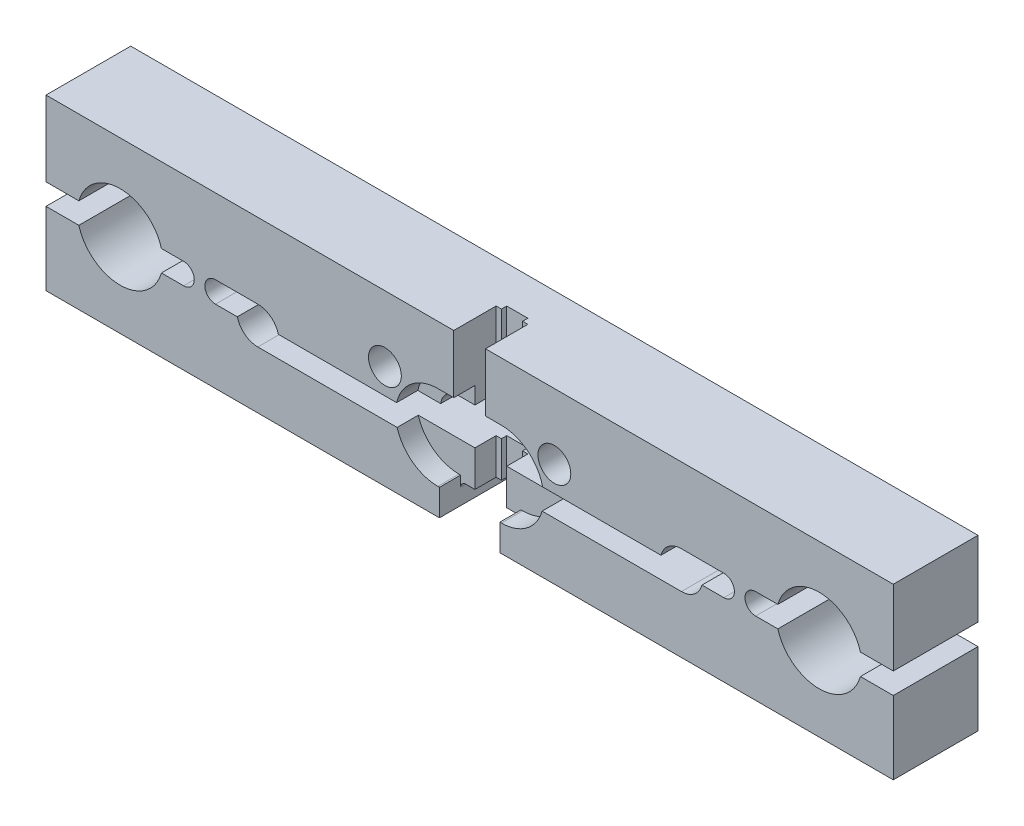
ISO-10303-21;
HEADER;
FILE_DESCRIPTION(('STEP AP214'),'2;1');
FILE_NAME('part.step','',(''),(''),'','','');
FILE_SCHEMA(('AUTOMOTIVE_DESIGN { 1 0 10303 214 1 1 1 1 }'));
ENDSEC;
DATA;
#1=APPLICATION_CONTEXT('core data for automotive mechanical design processes');
#2=APPLICATION_PROTOCOL_DEFINITION('international standard','automotive_design',2000,#1);
#3=PRODUCT_CONTEXT('',#1,'mechanical');
#4=PRODUCT('Part','Part','',(#3));
#5=PRODUCT_RELATED_PRODUCT_CATEGORY('part','',(#4));
#6=PRODUCT_DEFINITION_FORMATION('','',#4);
#7=PRODUCT_DEFINITION_CONTEXT('part definition',#1,'design');
#8=PRODUCT_DEFINITION('design','',#6,#7);
#9=PRODUCT_DEFINITION_SHAPE('','',#8);
#10=(LENGTH_UNIT() NAMED_UNIT(*) SI_UNIT(.MILLI.,.METRE.));
#11=(NAMED_UNIT(*) PLANE_ANGLE_UNIT() SI_UNIT($,.RADIAN.));
#12=(NAMED_UNIT(*) SI_UNIT($,.STERADIAN.) SOLID_ANGLE_UNIT());
#13=UNCERTAINTY_MEASURE_WITH_UNIT(LENGTH_MEASURE(1.E-05),#10,'distance_accuracy_value','');
#14=(GEOMETRIC_REPRESENTATION_CONTEXT(3) GLOBAL_UNCERTAINTY_ASSIGNED_CONTEXT((#13)) GLOBAL_UNIT_ASSIGNED_CONTEXT((#10,
#11,#12)) REPRESENTATION_CONTEXT('',''));
#15=CARTESIAN_POINT('',(0.,0.,0.));
#16=DIRECTION('',(0.,0.,1.));
#17=DIRECTION('',(1.,0.,0.));
#18=AXIS2_PLACEMENT_3D('',#15,#16,#17);
#19=CARTESIAN_POINT('',(0.,0.,4.));
#20=DIRECTION('',(0.,0.,-1.));
#21=DIRECTION('',(-1.,0.,0.));
#22=AXIS2_PLACEMENT_3D('',#19,#20,#21);
#23=PLANE('',#22);
#24=DIRECTION('',(1.,0.,0.));
#25=VECTOR('',#24,1.);
#26=CARTESIAN_POINT('',(0.,2.00000000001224,4.));
#27=LINE('',#26,#25);
#28=CARTESIAN_POINT('',(38.5,2.00000000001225,4.));
#29=VERTEX_POINT('',#28);
#30=CARTESIAN_POINT('',(39.,2.00000000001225,4.));
#31=VERTEX_POINT('',#30);
#32=EDGE_CURVE('E720',#29,#31,#27,.T.);
#33=ORIENTED_EDGE('',*,*,#32,.T.);
#34=DIRECTION('',(0.,-1.,0.));
#35=VECTOR('',#34,1.);
#36=CARTESIAN_POINT('',(39.,2.00000000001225,4.));
#37=LINE('',#36,#35);
#38=CARTESIAN_POINT('',(39.,5.4,4.));
#39=VERTEX_POINT('',#38);
#40=EDGE_CURVE('E1176',#39,#31,#37,.T.);
#41=ORIENTED_EDGE('',*,*,#40,.F.);
#42=DIRECTION('',(1.,0.,0.));
#43=VECTOR('',#42,1.);
#44=CARTESIAN_POINT('',(0.,5.4,4.));
#45=LINE('',#44,#43);
#46=CARTESIAN_POINT('',(38.5,5.4,4.));
#47=VERTEX_POINT('',#46);
#48=EDGE_CURVE('E1124',#47,#39,#45,.T.);
#49=ORIENTED_EDGE('',*,*,#48,.F.);
#50=DIRECTION('',(0.,-1.,0.));
#51=VECTOR('',#50,1.);
#52=CARTESIAN_POINT('',(38.5,1.22527014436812E-11,4.));
#53=LINE('',#52,#51);
#54=EDGE_CURVE('E734',#47,#29,#53,.T.);
#55=ORIENTED_EDGE('',*,*,#54,.T.);
#56=EDGE_LOOP('',(#33,#41,#49,#55));
#57=FACE_BOUND('',#56,.T.);
#58=ADVANCED_FACE('F38',(#57),#23,.F.);
#59=DIRECTION('',(1.,7.04008610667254E-13,0.));
#60=VECTOR('',#59,1.);
#61=CARTESIAN_POINT('',(-6.26567663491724E-12,8.89999999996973,4.));
#62=LINE('',#61,#60);
#63=CARTESIAN_POINT('',(38.5,8.89999999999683,4.));
#64=VERTEX_POINT('',#63);
#65=CARTESIAN_POINT('',(39.,8.89999999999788,4.));
#66=VERTEX_POINT('',#65);
#67=EDGE_CURVE('E579',#64,#66,#62,.T.);
#68=ORIENTED_EDGE('',*,*,#67,.T.);
#69=CARTESIAN_POINT('',(39.,16.,4.));
#70=VERTEX_POINT('',#69);
#71=EDGE_CURVE('E1174',#70,#66,#37,.T.);
#72=ORIENTED_EDGE('',*,*,#71,.F.);
#73=DIRECTION('',(-1.,0.,0.));
#74=VECTOR('',#73,1.);
#75=CARTESIAN_POINT('',(38.5,16.,4.));
#76=LINE('',#75,#74);
#77=CARTESIAN_POINT('',(38.5,16.,4.));
#78=VERTEX_POINT('',#77);
#79=EDGE_CURVE('E739',#70,#78,#76,.T.);
#80=ORIENTED_EDGE('',*,*,#79,.T.);
#81=EDGE_CURVE('E729',#78,#64,#53,.T.);
#82=ORIENTED_EDGE('',*,*,#81,.T.);
#83=EDGE_LOOP('',(#68,#72,#80,#82));
#84=FACE_BOUND('',#83,.T.);
#85=ADVANCED_FACE('F1187',(#84),#23,.F.);
#86=CARTESIAN_POINT('',(0.,7.39999999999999,0.));
#87=DIRECTION('',(0.,1.,0.));
#88=DIRECTION('',(-1.,0.,0.));
#89=AXIS2_PLACEMENT_3D('',#86,#87,#88);
#90=PLANE('',#89);
#91=DIRECTION('',(-1.,0.,0.));
#92=VECTOR('',#91,1.);
#93=CARTESIAN_POINT('',(0.,7.39999999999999,0.));
#94=LINE('',#93,#92);
#95=CARTESIAN_POINT('',(35.2679491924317,7.4,0.));
#96=VERTEX_POINT('',#95);
#97=CARTESIAN_POINT('',(21.9364916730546,7.4,0.));
#98=VERTEX_POINT('',#97);
#99=EDGE_CURVE('E892',#96,#98,#94,.T.);
#100=ORIENTED_EDGE('',*,*,#99,.F.);
#101=DIRECTION('',(0.,0.,1.));
#102=VECTOR('',#101,1.);
#103=CARTESIAN_POINT('',(35.2679491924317,7.4,0.));
#104=LINE('',#103,#102);
#105=CARTESIAN_POINT('',(35.2679491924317,7.4,6.));
#106=VERTEX_POINT('',#105);
#107=EDGE_CURVE('E570',#96,#106,#104,.T.);
#108=ORIENTED_EDGE('',*,*,#107,.T.);
#109=DIRECTION('',(1.,0.,0.));
#110=VECTOR('',#109,1.);
#111=CARTESIAN_POINT('',(0.,7.39999999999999,6.));
#112=LINE('',#111,#110);
#113=CARTESIAN_POINT('',(33.102564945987,7.4,6.));
#114=VERTEX_POINT('',#113);
#115=EDGE_CURVE('E646',#114,#106,#112,.T.);
#116=ORIENTED_EDGE('',*,*,#115,.F.);
#117=DIRECTION('',(0.,0.,1.));
#118=VECTOR('',#117,1.);
#119=CARTESIAN_POINT('',(33.102564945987,7.4,6.));
#120=LINE('',#119,#118);
#121=CARTESIAN_POINT('',(33.102564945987,7.4,8.));
#122=VERTEX_POINT('',#121);
#123=EDGE_CURVE('E667',#114,#122,#120,.T.);
#124=ORIENTED_EDGE('',*,*,#123,.T.);
#125=DIRECTION('',(-1.,0.,0.));
#126=VECTOR('',#125,1.);
#127=CARTESIAN_POINT('',(0.,7.39999999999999,8.));
#128=LINE('',#127,#126);
#129=CARTESIAN_POINT('',(21.9364916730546,7.4,8.));
#130=VERTEX_POINT('',#129);
#131=EDGE_CURVE('E943',#122,#130,#128,.T.);
#132=ORIENTED_EDGE('',*,*,#131,.T.);
#133=DIRECTION('',(0.,0.,1.));
#134=VECTOR('',#133,1.);
#135=CARTESIAN_POINT('',(21.9364916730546,7.4,0.));
#136=LINE('',#135,#134);
#137=EDGE_CURVE('E967',#98,#130,#136,.T.);
#138=ORIENTED_EDGE('',*,*,#137,.F.);
#139=EDGE_LOOP('',(#100,#108,#116,#124,#132,#138));
#140=FACE_BOUND('',#139,.T.);
#141=ADVANCED_FACE('F1241',(#140),#90,.F.);
#142=CARTESIAN_POINT('',(0.,0.,8.));
#143=DIRECTION('',(0.,1.,0.));
#144=DIRECTION('',(0.,0.,1.));
#145=AXIS2_PLACEMENT_3D('',#142,#143,#144);
#146=PLANE('',#145);
#147=DIRECTION('',(1.,0.,0.));
#148=VECTOR('',#147,1.);
#149=CARTESIAN_POINT('',(0.,0.,8.));
#150=LINE('',#149,#148);
#151=CARTESIAN_POINT('',(42.85,1.22490917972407E-11,8.));
#152=VERTEX_POINT('',#151);
#153=CARTESIAN_POINT('',(80.,0.,8.));
#154=VERTEX_POINT('',#153);
#155=EDGE_CURVE('E1074',#152,#154,#150,.T.);
#156=ORIENTED_EDGE('',*,*,#155,.F.);
#157=DIRECTION('',(0.,0.,1.));
#158=VECTOR('',#157,1.);
#159=CARTESIAN_POINT('',(42.85,1.22490917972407E-11,0.));
#160=LINE('',#159,#158);
#161=CARTESIAN_POINT('',(42.85,1.22490917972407E-11,0.));
#162=VERTEX_POINT('',#161);
#163=EDGE_CURVE('E707',#162,#152,#160,.T.);
#164=ORIENTED_EDGE('',*,*,#163,.F.);
#165=DIRECTION('',(1.,0.,0.));
#166=VECTOR('',#165,1.);
#167=CARTESIAN_POINT('',(0.,0.,0.));
#168=LINE('',#167,#166);
#169=CARTESIAN_POINT('',(80.,0.,0.));
#170=VERTEX_POINT('',#169);
#171=EDGE_CURVE('E1095',#162,#170,#168,.T.);
#172=ORIENTED_EDGE('',*,*,#171,.T.);
#173=DIRECTION('',(0.,0.,-1.));
#174=VECTOR('',#173,1.);
#175=CARTESIAN_POINT('',(80.,0.,8.));
#176=LINE('',#175,#174);
#177=EDGE_CURVE('E1115',#154,#170,#176,.T.);
#178=ORIENTED_EDGE('',*,*,#177,.F.);
#179=EDGE_LOOP('',(#156,#164,#172,#178));
#180=FACE_BOUND('',#179,.T.);
#181=ADVANCED_FACE('F1375',(#180),#146,.F.);
#182=CARTESIAN_POINT('',(0.,0.,8.));
#183=DIRECTION('',(0.,0.,1.));
#184=DIRECTION('',(1.,0.,0.));
#185=AXIS2_PLACEMENT_3D('',#182,#183,#184);
#186=PLANE('',#185);
#187=DIRECTION('',(0.,-1.,0.));
#188=VECTOR('',#187,1.);
#189=CARTESIAN_POINT('',(37.15,0.,8.));
#190=LINE('',#189,#188);
#191=CARTESIAN_POINT('',(37.15,2.50000000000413,8.));
#192=VERTEX_POINT('',#191);
#193=CARTESIAN_POINT('',(37.15,0.,8.));
#194=VERTEX_POINT('',#193);
#195=EDGE_CURVE('E671',#192,#194,#190,.T.);
#196=ORIENTED_EDGE('',*,*,#195,.F.);
#197=DIRECTION('',(1.,-2.7561864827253E-12,0.));
#198=VECTOR('',#197,1.);
#199=CARTESIAN_POINT('',(43.,2.5,8.));
#200=LINE('',#199,#198);
#201=CARTESIAN_POINT('',(36.999999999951,2.50000000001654,8.));
#202=VERTEX_POINT('',#201);
#203=EDGE_CURVE('E615',#202,#192,#200,.T.);
#204=ORIENTED_EDGE('',*,*,#203,.F.);
#205=CARTESIAN_POINT('',(36.999999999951,6.5,8.));
#206=DIRECTION('',(0.,0.,1.));
#207=DIRECTION('',(1.,0.,0.));
#208=AXIS2_PLACEMENT_3D('',#205,#206,#207);
#209=CIRCLE('',#208,3.99999999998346);
#210=CARTESIAN_POINT('',(33.1542230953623,5.4,8.));
#211=VERTEX_POINT('',#210);
#212=EDGE_CURVE('E590',#211,#202,#209,.T.);
#213=ORIENTED_EDGE('',*,*,#212,.F.);
#214=DIRECTION('',(1.,0.,0.));
#215=VECTOR('',#214,1.);
#216=CARTESIAN_POINT('',(0.,5.4,8.));
#217=LINE('',#216,#215);
#218=CARTESIAN_POINT('',(19.9999999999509,5.4,8.));
#219=VERTEX_POINT('',#218);
#220=EDGE_CURVE('E919',#219,#211,#217,.T.);
#221=ORIENTED_EDGE('',*,*,#220,.F.);
#222=CARTESIAN_POINT('',(20.,7.4,8.));
#223=DIRECTION('',(0.,0.,1.));
#224=DIRECTION('',(1.,0.,0.));
#225=AXIS2_PLACEMENT_3D('',#222,#223,#224);
#226=CIRCLE('',#225,2.);
#227=CARTESIAN_POINT('',(18.0635083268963,6.9,8.));
#228=VERTEX_POINT('',#227);
#229=EDGE_CURVE('E913',#228,#219,#226,.T.);
#230=ORIENTED_EDGE('',*,*,#229,.F.);
#231=DIRECTION('',(1.,0.,0.));
#232=VECTOR('',#231,1.);
#233=CARTESIAN_POINT('',(0.,6.9,8.));
#234=LINE('',#233,#232);
#235=CARTESIAN_POINT('',(15.999999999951,6.9,8.));
#236=VERTEX_POINT('',#235);
#237=EDGE_CURVE('E910',#236,#228,#234,.T.);
#238=ORIENTED_EDGE('',*,*,#237,.F.);
#239=CARTESIAN_POINT('',(15.999999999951,7.90000000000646,8.));
#240=DIRECTION('',(0.,0.,1.));
#241=DIRECTION('',(1.,0.,0.));
#242=AXIS2_PLACEMENT_3D('',#239,#240,#241);
#243=CIRCLE('',#242,0.999999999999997);
#244=CARTESIAN_POINT('',(15.999999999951,8.9,8.));
#245=VERTEX_POINT('',#244);
#246=EDGE_CURVE('E865',#245,#236,#243,.T.);
#247=ORIENTED_EDGE('',*,*,#246,.F.);
#248=DIRECTION('',(-1.,0.,0.));
#249=VECTOR('',#248,1.);
#250=CARTESIAN_POINT('',(1.92987986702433E-13,8.90000000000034,8.));
#251=LINE('',#250,#249);
#252=CARTESIAN_POINT('',(19.9999999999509,8.89999999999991,8.));
#253=VERTEX_POINT('',#252);
#254=EDGE_CURVE('E952',#253,#245,#251,.T.);
#255=ORIENTED_EDGE('',*,*,#254,.F.);
#256=CARTESIAN_POINT('',(19.9999999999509,6.89999999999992,8.));
#257=DIRECTION('',(0.,0.,1.));
#258=DIRECTION('',(1.,0.,0.));
#259=AXIS2_PLACEMENT_3D('',#256,#257,#258);
#260=CIRCLE('',#259,1.99999999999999);
#261=EDGE_CURVE('E948',#253,#130,#260,.F.);
#262=ORIENTED_EDGE('',*,*,#261,.T.);
#263=ORIENTED_EDGE('',*,*,#131,.F.);
#264=CARTESIAN_POINT('',(36.999999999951,10.4999999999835,8.));
#265=VERTEX_POINT('',#264);
#266=EDGE_CURVE('E611',#265,#122,#209,.T.);
#267=ORIENTED_EDGE('',*,*,#266,.F.);
#268=DIRECTION('',(-1.,-2.75618648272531E-12,0.));
#269=VECTOR('',#268,1.);
#270=CARTESIAN_POINT('',(36.999999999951,10.4999999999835,8.));
#271=LINE('',#270,#269);
#272=CARTESIAN_POINT('',(38.5,10.4999999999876,8.));
#273=VERTEX_POINT('',#272);
#274=EDGE_CURVE('E623',#273,#265,#271,.T.);
#275=ORIENTED_EDGE('',*,*,#274,.F.);
#276=DIRECTION('',(0.,-1.,0.));
#277=VECTOR('',#276,1.);
#278=CARTESIAN_POINT('',(38.5,1.22527014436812E-11,8.));
#279=LINE('',#278,#277);
#280=CARTESIAN_POINT('',(38.5,16.,8.));
#281=VERTEX_POINT('',#280);
#282=EDGE_CURVE('E728',#281,#273,#279,.T.);
#283=ORIENTED_EDGE('',*,*,#282,.F.);
#284=DIRECTION('',(-1.,0.,0.));
#285=VECTOR('',#284,1.);
#286=CARTESIAN_POINT('',(80.,16.,8.));
#287=LINE('',#286,#285);
#288=CARTESIAN_POINT('',(-4.89897908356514E-11,16.,8.));
#289=VERTEX_POINT('',#288);
#290=EDGE_CURVE('E1085',#281,#289,#287,.T.);
#291=ORIENTED_EDGE('',*,*,#290,.T.);
#292=DIRECTION('',(3.06186192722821E-12,-1.,0.));
#293=VECTOR('',#292,1.);
#294=CARTESIAN_POINT('',(-4.89897908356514E-11,16.,8.));
#295=LINE('',#294,#293);
#296=CARTESIAN_POINT('',(-2.72505711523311E-11,8.89999999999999,8.));
#297=VERTEX_POINT('',#296);
#298=EDGE_CURVE('E1070',#289,#297,#295,.T.);
#299=ORIENTED_EDGE('',*,*,#298,.T.);
#300=DIRECTION('',(-1.,0.,0.));
#301=VECTOR('',#300,1.);
#302=CARTESIAN_POINT('',(0.,8.89999999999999,8.));
#303=LINE('',#302,#301);
#304=CARTESIAN_POINT('',(3.10224423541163,8.89999999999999,8.));
#305=VERTEX_POINT('',#304);
#306=EDGE_CURVE('E768',#305,#297,#303,.T.);
#307=ORIENTED_EDGE('',*,*,#306,.F.);
#308=CARTESIAN_POINT('',(6.99999999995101,7.8,8.));
#309=DIRECTION('',(0.,0.,1.));
#310=DIRECTION('',(1.,0.,0.));
#311=AXIS2_PLACEMENT_3D('',#308,#309,#310);
#312=CIRCLE('',#311,4.05);
#313=CARTESIAN_POINT('',(10.8977557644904,8.9,8.));
#314=VERTEX_POINT('',#313);
#315=EDGE_CURVE('E1042',#314,#305,#312,.T.);
#316=ORIENTED_EDGE('',*,*,#315,.F.);
#317=DIRECTION('',(-1.,0.,0.));
#318=VECTOR('',#317,1.);
#319=CARTESIAN_POINT('',(0.,8.89999999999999,8.));
#320=LINE('',#319,#318);
#321=CARTESIAN_POINT('',(12.999999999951,8.9,8.));
#322=VERTEX_POINT('',#321);
#323=EDGE_CURVE('E831',#322,#314,#320,.T.);
#324=ORIENTED_EDGE('',*,*,#323,.F.);
#325=CARTESIAN_POINT('',(12.999999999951,7.90000000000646,8.));
#326=DIRECTION('',(0.,0.,1.));
#327=DIRECTION('',(1.,0.,0.));
#328=AXIS2_PLACEMENT_3D('',#325,#326,#327);
#329=CIRCLE('',#328,0.999999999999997);
#330=CARTESIAN_POINT('',(12.999999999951,6.9,8.));
#331=VERTEX_POINT('',#330);
#332=EDGE_CURVE('E843',#331,#322,#329,.T.);
#333=ORIENTED_EDGE('',*,*,#332,.F.);
#334=DIRECTION('',(1.,0.,0.));
#335=VECTOR('',#334,1.);
#336=CARTESIAN_POINT('',(0.,6.9,8.));
#337=LINE('',#336,#335);
#338=CARTESIAN_POINT('',(10.8977557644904,6.9,8.));
#339=VERTEX_POINT('',#338);
#340=EDGE_CURVE('E754',#339,#331,#337,.T.);
#341=ORIENTED_EDGE('',*,*,#340,.F.);
#342=CARTESIAN_POINT('',(6.99999999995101,8.,8.));
#343=DIRECTION('',(0.,0.,1.));
#344=DIRECTION('',(1.,0.,0.));
#345=AXIS2_PLACEMENT_3D('',#342,#343,#344);
#346=CIRCLE('',#345,4.05);
#347=CARTESIAN_POINT('',(3.10224423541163,6.9,8.));
#348=VERTEX_POINT('',#347);
#349=EDGE_CURVE('E1038',#348,#339,#346,.T.);
#350=ORIENTED_EDGE('',*,*,#349,.F.);
#351=DIRECTION('',(1.,0.,0.));
#352=VECTOR('',#351,1.);
#353=CARTESIAN_POINT('',(0.,6.9,8.));
#354=LINE('',#353,#352);
#355=CARTESIAN_POINT('',(-2.11268472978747E-11,6.9,8.));
#356=VERTEX_POINT('',#355);
#357=EDGE_CURVE('E763',#356,#348,#354,.T.);
#358=ORIENTED_EDGE('',*,*,#357,.F.);
#359=CARTESIAN_POINT('',(0.,0.,8.));
#360=VERTEX_POINT('',#359);
#361=EDGE_CURVE('E1075',#356,#360,#295,.T.);
#362=ORIENTED_EDGE('',*,*,#361,.T.);
#363=EDGE_CURVE('E1076',#360,#194,#150,.T.);
#364=ORIENTED_EDGE('',*,*,#363,.T.);
#365=EDGE_LOOP('',(#196,#204,#213,#221,#230,#238,#247,#255,#262,#263,#267,#275,#283,#291,#299,
#307,#316,#324,#333,#341,#350,#358,#362,#364));
#366=FACE_BOUND('',#365,.T.);
#367=CARTESIAN_POINT('',(32.,9.8,8.));
#368=DIRECTION('',(0.,0.,1.));
#369=DIRECTION('',(1.,0.,0.));
#370=AXIS2_PLACEMENT_3D('',#367,#368,#369);
#371=CIRCLE('',#370,1.55);
#372=CARTESIAN_POINT('',(33.55,9.8,8.));
#373=VERTEX_POINT('',#372);
#374=EDGE_CURVE('E778',#373,#373,#371,.T.);
#375=ORIENTED_EDGE('',*,*,#374,.F.);
#376=EDGE_LOOP('',(#375));
#377=FACE_BOUND('',#376,.T.);
#378=ADVANCED_FACE('F1264',(#366,#377),#186,.T.);
#379=CARTESIAN_POINT('',(-4.89897908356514E-11,16.,8.));
#380=DIRECTION('',(1.,3.06186192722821E-12,0.));
#381=DIRECTION('',(-3.06186192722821E-12,1.,0.));
#382=AXIS2_PLACEMENT_3D('',#379,#380,#381);
#383=PLANE('',#382);
#384=ORIENTED_EDGE('',*,*,#361,.F.);
#385=DIRECTION('',(0.,0.,1.));
#386=VECTOR('',#385,1.);
#387=CARTESIAN_POINT('',(-2.11268472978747E-11,6.9,0.));
#388=LINE('',#387,#386);
#389=CARTESIAN_POINT('',(-2.11268472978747E-11,6.9,0.));
#390=VERTEX_POINT('',#389);
#391=EDGE_CURVE('E779',#390,#356,#388,.T.);
#392=ORIENTED_EDGE('',*,*,#391,.F.);
#393=DIRECTION('',(3.06186192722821E-12,-1.,0.));
#394=VECTOR('',#393,1.);
#395=CARTESIAN_POINT('',(-4.89897908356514E-11,16.,0.));
#396=LINE('',#395,#394);
#397=CARTESIAN_POINT('',(0.,0.,0.));
#398=VERTEX_POINT('',#397);
#399=EDGE_CURVE('E1063',#390,#398,#396,.T.);
#400=ORIENTED_EDGE('',*,*,#399,.T.);
#401=DIRECTION('',(0.,0.,-1.));
#402=VECTOR('',#401,1.);
#403=CARTESIAN_POINT('',(0.,0.,8.));
#404=LINE('',#403,#402);
#405=EDGE_CURVE('E1119',#360,#398,#404,.T.);
#406=ORIENTED_EDGE('',*,*,#405,.F.);
#407=EDGE_LOOP('',(#384,#392,#400,#406));
#408=FACE_BOUND('',#407,.T.);
#409=ADVANCED_FACE('F1380',(#408),#383,.F.);
#410=CARTESIAN_POINT('',(80.,0.,8.));
#411=DIRECTION('',(-1.,0.,0.));
#412=DIRECTION('',(0.,0.,1.));
#413=AXIS2_PLACEMENT_3D('',#410,#411,#412);
#414=PLANE('',#413);
#415=DIRECTION('',(0.,1.,0.));
#416=VECTOR('',#415,1.);
#417=CARTESIAN_POINT('',(80.,0.,8.));
#418=LINE('',#417,#416);
#419=CARTESIAN_POINT('',(80.,8.9,8.));
#420=VERTEX_POINT('',#419);
#421=CARTESIAN_POINT('',(80.,16.,8.));
#422=VERTEX_POINT('',#421);
#423=EDGE_CURVE('E1080',#420,#422,#418,.T.);
#424=ORIENTED_EDGE('',*,*,#423,.F.);
#425=DIRECTION('',(0.,0.,1.));
#426=VECTOR('',#425,1.);
#427=CARTESIAN_POINT('',(80.,8.9,0.));
#428=LINE('',#427,#426);
#429=CARTESIAN_POINT('',(80.,8.9,0.));
#430=VERTEX_POINT('',#429);
#431=EDGE_CURVE('E1013',#430,#420,#428,.T.);
#432=ORIENTED_EDGE('',*,*,#431,.F.);
#433=DIRECTION('',(0.,1.,0.));
#434=VECTOR('',#433,1.);
#435=CARTESIAN_POINT('',(80.,0.,0.));
#436=LINE('',#435,#434);
#437=CARTESIAN_POINT('',(80.,16.,0.));
#438=VERTEX_POINT('',#437);
#439=EDGE_CURVE('E1100',#430,#438,#436,.T.);
#440=ORIENTED_EDGE('',*,*,#439,.T.);
#441=DIRECTION('',(0.,0.,-1.));
#442=VECTOR('',#441,1.);
#443=CARTESIAN_POINT('',(80.,16.,8.));
#444=LINE('',#443,#442);
#445=EDGE_CURVE('E1111',#422,#438,#444,.T.);
#446=ORIENTED_EDGE('',*,*,#445,.F.);
#447=EDGE_LOOP('',(#424,#432,#440,#446));
#448=FACE_BOUND('',#447,.T.);
#449=ADVANCED_FACE('F1362',(#448),#414,.F.);
#450=CARTESIAN_POINT('',(42.85,2.50000000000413,8.));
#451=VERTEX_POINT('',#450);
#452=CARTESIAN_POINT('',(43.,2.5,8.));
#453=VERTEX_POINT('',#452);
#454=EDGE_CURVE('E614',#451,#453,#200,.T.);
#455=ORIENTED_EDGE('',*,*,#454,.F.);
#456=DIRECTION('',(0.,1.,0.));
#457=VECTOR('',#456,1.);
#458=CARTESIAN_POINT('',(42.85,0.,8.));
#459=LINE('',#458,#457);
#460=EDGE_CURVE('E677',#152,#451,#459,.T.);
#461=ORIENTED_EDGE('',*,*,#460,.F.);
#462=ORIENTED_EDGE('',*,*,#155,.T.);
#463=CARTESIAN_POINT('',(80.,6.9,8.));
#464=VERTEX_POINT('',#463);
#465=EDGE_CURVE('E1081',#154,#464,#418,.T.);
#466=ORIENTED_EDGE('',*,*,#465,.T.);
#467=DIRECTION('',(1.,0.,0.));
#468=VECTOR('',#467,1.);
#469=CARTESIAN_POINT('',(0.,6.9,8.));
#470=LINE('',#469,#468);
#471=CARTESIAN_POINT('',(76.8977557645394,6.9,8.));
#472=VERTEX_POINT('',#471);
#473=EDGE_CURVE('E816',#472,#464,#470,.T.);
#474=ORIENTED_EDGE('',*,*,#473,.F.);
#475=CARTESIAN_POINT('',(73.,8.,8.));
#476=DIRECTION('',(0.,0.,1.));
#477=DIRECTION('',(1.,0.,0.));
#478=AXIS2_PLACEMENT_3D('',#475,#476,#477);
#479=CIRCLE('',#478,4.04999999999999);
#480=CARTESIAN_POINT('',(69.1022442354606,6.9,8.));
#481=VERTEX_POINT('',#480);
#482=EDGE_CURVE('E1054',#481,#472,#479,.T.);
#483=ORIENTED_EDGE('',*,*,#482,.F.);
#484=DIRECTION('',(1.,0.,0.));
#485=VECTOR('',#484,1.);
#486=CARTESIAN_POINT('',(0.,6.9,8.));
#487=LINE('',#486,#485);
#488=CARTESIAN_POINT('',(67.,6.9,8.));
#489=VERTEX_POINT('',#488);
#490=EDGE_CURVE('E793',#489,#481,#487,.T.);
#491=ORIENTED_EDGE('',*,*,#490,.F.);
#492=CARTESIAN_POINT('',(67.,7.9,8.));
#493=DIRECTION('',(0.,0.,1.));
#494=DIRECTION('',(1.,0.,0.));
#495=AXIS2_PLACEMENT_3D('',#492,#493,#494);
#496=CIRCLE('',#495,1.);
#497=CARTESIAN_POINT('',(67.,8.9,8.));
#498=VERTEX_POINT('',#497);
#499=EDGE_CURVE('E806',#498,#489,#496,.T.);
#500=ORIENTED_EDGE('',*,*,#499,.F.);
#501=DIRECTION('',(-1.,0.,0.));
#502=VECTOR('',#501,1.);
#503=CARTESIAN_POINT('',(0.,8.89999999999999,8.));
#504=LINE('',#503,#502);
#505=CARTESIAN_POINT('',(69.1022442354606,8.9,8.));
#506=VERTEX_POINT('',#505);
#507=EDGE_CURVE('E802',#506,#498,#504,.T.);
#508=ORIENTED_EDGE('',*,*,#507,.F.);
#509=CARTESIAN_POINT('',(73.,7.8,8.));
#510=DIRECTION('',(0.,0.,1.));
#511=DIRECTION('',(1.,0.,0.));
#512=AXIS2_PLACEMENT_3D('',#509,#510,#511);
#513=CIRCLE('',#512,4.04999999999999);
#514=CARTESIAN_POINT('',(76.8977557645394,8.9,8.));
#515=VERTEX_POINT('',#514);
#516=EDGE_CURVE('E1058',#515,#506,#513,.T.);
#517=ORIENTED_EDGE('',*,*,#516,.F.);
#518=DIRECTION('',(-1.,0.,0.));
#519=VECTOR('',#518,1.);
#520=CARTESIAN_POINT('',(0.,8.89999999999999,8.));
#521=LINE('',#520,#519);
#522=EDGE_CURVE('E1001',#420,#515,#521,.T.);
#523=ORIENTED_EDGE('',*,*,#522,.F.);
#524=ORIENTED_EDGE('',*,*,#423,.T.);
#525=CARTESIAN_POINT('',(41.5,16.,8.));
#526=VERTEX_POINT('',#525);
#527=EDGE_CURVE('E1086',#422,#526,#287,.T.);
#528=ORIENTED_EDGE('',*,*,#527,.T.);
#529=DIRECTION('',(0.,1.,0.));
#530=VECTOR('',#529,1.);
#531=CARTESIAN_POINT('',(41.5,16.,8.));
#532=LINE('',#531,#530);
#533=CARTESIAN_POINT('',(41.5,10.4999999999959,8.));
#534=VERTEX_POINT('',#533);
#535=EDGE_CURVE('E748',#534,#526,#532,.T.);
#536=ORIENTED_EDGE('',*,*,#535,.F.);
#537=CARTESIAN_POINT('',(43.,10.5,8.));
#538=VERTEX_POINT('',#537);
#539=EDGE_CURVE('E624',#538,#534,#271,.T.);
#540=ORIENTED_EDGE('',*,*,#539,.F.);
#541=CARTESIAN_POINT('',(43.,6.5,8.));
#542=DIRECTION('',(0.,0.,1.));
#543=DIRECTION('',(1.,0.,0.));
#544=AXIS2_PLACEMENT_3D('',#541,#542,#543);
#545=CIRCLE('',#544,4.);
#546=CARTESIAN_POINT('',(46.897435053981,7.4,8.));
#547=VERTEX_POINT('',#546);
#548=EDGE_CURVE('E619',#547,#538,#545,.T.);
#549=ORIENTED_EDGE('',*,*,#548,.F.);
#550=CARTESIAN_POINT('',(58.0635083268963,7.4,8.));
#551=VERTEX_POINT('',#550);
#552=EDGE_CURVE('E944',#551,#547,#128,.T.);
#553=ORIENTED_EDGE('',*,*,#552,.F.);
#554=CARTESIAN_POINT('',(60.,6.9,8.));
#555=DIRECTION('',(0.,0.,1.));
#556=DIRECTION('',(1.,0.,0.));
#557=AXIS2_PLACEMENT_3D('',#554,#555,#556);
#558=CIRCLE('',#557,2.);
#559=CARTESIAN_POINT('',(60.,8.9,8.));
#560=VERTEX_POINT('',#559);
#561=EDGE_CURVE('E939',#560,#551,#558,.T.);
#562=ORIENTED_EDGE('',*,*,#561,.F.);
#563=DIRECTION('',(-1.,0.,0.));
#564=VECTOR('',#563,1.);
#565=CARTESIAN_POINT('',(0.,8.90000000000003,8.));
#566=LINE('',#565,#564);
#567=CARTESIAN_POINT('',(64.,8.9,8.));
#568=VERTEX_POINT('',#567);
#569=EDGE_CURVE('E935',#568,#560,#566,.T.);
#570=ORIENTED_EDGE('',*,*,#569,.F.);
#571=CARTESIAN_POINT('',(64.,7.9,8.));
#572=DIRECTION('',(0.,0.,1.));
#573=DIRECTION('',(1.,0.,0.));
#574=AXIS2_PLACEMENT_3D('',#571,#572,#573);
#575=CIRCLE('',#574,0.999999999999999);
#576=CARTESIAN_POINT('',(64.,6.9,8.));
#577=VERTEX_POINT('',#576);
#578=EDGE_CURVE('E931',#577,#568,#575,.T.);
#579=ORIENTED_EDGE('',*,*,#578,.F.);
#580=DIRECTION('',(1.,0.,0.));
#581=VECTOR('',#580,1.);
#582=CARTESIAN_POINT('',(0.,6.9,8.));
#583=LINE('',#582,#581);
#584=CARTESIAN_POINT('',(61.9364916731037,6.9,8.));
#585=VERTEX_POINT('',#584);
#586=EDGE_CURVE('E927',#585,#577,#583,.T.);
#587=ORIENTED_EDGE('',*,*,#586,.F.);
#588=CARTESIAN_POINT('',(60.,7.4,8.));
#589=DIRECTION('',(0.,0.,1.));
#590=DIRECTION('',(1.,0.,0.));
#591=AXIS2_PLACEMENT_3D('',#588,#589,#590);
#592=CIRCLE('',#591,2.00000000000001);
#593=CARTESIAN_POINT('',(60.,5.4,8.));
#594=VERTEX_POINT('',#593);
#595=EDGE_CURVE('E923',#594,#585,#592,.T.);
#596=ORIENTED_EDGE('',*,*,#595,.F.);
#597=CARTESIAN_POINT('',(46.8457769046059,5.4,8.));
#598=VERTEX_POINT('',#597);
#599=EDGE_CURVE('E918',#598,#594,#217,.T.);
#600=ORIENTED_EDGE('',*,*,#599,.F.);
#601=EDGE_CURVE('E620',#453,#598,#545,.T.);
#602=ORIENTED_EDGE('',*,*,#601,.F.);
#603=EDGE_LOOP('',(#455,#461,#462,#466,#474,#483,#491,#500,#508,#517,#523,#524,#528,#536,#540,
#549,#553,#562,#570,#579,#587,#596,#600,#602));
#604=FACE_BOUND('',#603,.T.);
#605=CARTESIAN_POINT('',(48.,9.8,8.));
#606=DIRECTION('',(0.,0.,1.));
#607=DIRECTION('',(1.,0.,0.));
#608=AXIS2_PLACEMENT_3D('',#605,#606,#607);
#609=CIRCLE('',#608,1.55);
#610=CARTESIAN_POINT('',(49.55,9.8,8.));
#611=VERTEX_POINT('',#610);
#612=EDGE_CURVE('E1027',#611,#611,#609,.T.);
#613=ORIENTED_EDGE('',*,*,#612,.F.);
#614=EDGE_LOOP('',(#613));
#615=FACE_BOUND('',#614,.T.);
#616=ADVANCED_FACE('F1359',(#604,#615),#186,.T.);
#617=CARTESIAN_POINT('',(0.,0.,0.));
#618=DIRECTION('',(0.,0.,1.));
#619=DIRECTION('',(1.,0.,0.));
#620=AXIS2_PLACEMENT_3D('',#617,#618,#619);
#621=PLANE('',#620);
#622=ORIENTED_EDGE('',*,*,#171,.F.);
#623=DIRECTION('',(0.,1.,0.));
#624=VECTOR('',#623,1.);
#625=CARTESIAN_POINT('',(42.85,0.,0.));
#626=LINE('',#625,#624);
#627=CARTESIAN_POINT('',(42.85,1.50000000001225,0.));
#628=VERTEX_POINT('',#627);
#629=EDGE_CURVE('E685',#162,#628,#626,.T.);
#630=ORIENTED_EDGE('',*,*,#629,.T.);
#631=CARTESIAN_POINT('',(42.35,1.50000000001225,0.));
#632=DIRECTION('',(0.,0.,1.));
#633=DIRECTION('',(1.,0.,0.));
#634=AXIS2_PLACEMENT_3D('',#631,#632,#633);
#635=CIRCLE('',#634,0.499999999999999);
#636=CARTESIAN_POINT('',(42.35,2.00000000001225,0.));
#637=VERTEX_POINT('',#636);
#638=EDGE_CURVE('E689',#628,#637,#635,.T.);
#639=ORIENTED_EDGE('',*,*,#638,.T.);
#640=DIRECTION('',(-1.,0.,0.));
#641=VECTOR('',#640,1.);
#642=CARTESIAN_POINT('',(0.,2.00000000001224,0.));
#643=LINE('',#642,#641);
#644=CARTESIAN_POINT('',(37.6499999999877,2.00000000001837,0.));
#645=VERTEX_POINT('',#644);
#646=EDGE_CURVE('E672',#637,#645,#643,.T.);
#647=ORIENTED_EDGE('',*,*,#646,.T.);
#648=CARTESIAN_POINT('',(37.6499999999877,1.5000000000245,0.));
#649=DIRECTION('',(0.,0.,1.));
#650=DIRECTION('',(1.,0.,0.));
#651=AXIS2_PLACEMENT_3D('',#648,#649,#650);
#652=CIRCLE('',#651,0.499999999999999);
#653=CARTESIAN_POINT('',(37.1499999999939,1.5000000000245,0.));
#654=VERTEX_POINT('',#653);
#655=EDGE_CURVE('E676',#645,#654,#652,.T.);
#656=ORIENTED_EDGE('',*,*,#655,.T.);
#657=DIRECTION('',(0.,-1.,0.));
#658=VECTOR('',#657,1.);
#659=CARTESIAN_POINT('',(37.15,0.,0.));
#660=LINE('',#659,#658);
#661=CARTESIAN_POINT('',(37.15,0.,0.));
#662=VERTEX_POINT('',#661);
#663=EDGE_CURVE('E681',#654,#662,#660,.T.);
#664=ORIENTED_EDGE('',*,*,#663,.T.);
#665=EDGE_CURVE('E1096',#398,#662,#168,.T.);
#666=ORIENTED_EDGE('',*,*,#665,.F.);
#667=ORIENTED_EDGE('',*,*,#399,.F.);
#668=DIRECTION('',(1.,0.,0.));
#669=VECTOR('',#668,1.);
#670=CARTESIAN_POINT('',(0.,6.9,0.));
#671=LINE('',#670,#669);
#672=CARTESIAN_POINT('',(3.10224423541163,6.9,0.));
#673=VERTEX_POINT('',#672);
#674=EDGE_CURVE('E762',#390,#673,#671,.T.);
#675=ORIENTED_EDGE('',*,*,#674,.T.);
#676=CARTESIAN_POINT('',(6.99999999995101,8.,0.));
#677=DIRECTION('',(0.,0.,1.));
#678=DIRECTION('',(1.,0.,0.));
#679=AXIS2_PLACEMENT_3D('',#676,#677,#678);
#680=CIRCLE('',#679,4.05);
#681=CARTESIAN_POINT('',(10.8977557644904,6.9,0.));
#682=VERTEX_POINT('',#681);
#683=EDGE_CURVE('E1026',#673,#682,#680,.T.);
#684=ORIENTED_EDGE('',*,*,#683,.T.);
#685=DIRECTION('',(1.,0.,0.));
#686=VECTOR('',#685,1.);
#687=CARTESIAN_POINT('',(0.,6.9,0.));
#688=LINE('',#687,#686);
#689=CARTESIAN_POINT('',(12.999999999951,6.9,0.));
#690=VERTEX_POINT('',#689);
#691=EDGE_CURVE('E826',#682,#690,#688,.T.);
#692=ORIENTED_EDGE('',*,*,#691,.T.);
#693=CARTESIAN_POINT('',(12.999999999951,7.90000000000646,0.));
#694=DIRECTION('',(0.,0.,1.));
#695=DIRECTION('',(1.,0.,0.));
#696=AXIS2_PLACEMENT_3D('',#693,#694,#695);
#697=CIRCLE('',#696,0.999999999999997);
#698=CARTESIAN_POINT('',(12.999999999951,8.9,0.));
#699=VERTEX_POINT('',#698);
#700=EDGE_CURVE('E830',#690,#699,#697,.T.);
#701=ORIENTED_EDGE('',*,*,#700,.T.);
#702=DIRECTION('',(-1.,0.,0.));
#703=VECTOR('',#702,1.);
#704=CARTESIAN_POINT('',(0.,8.89999999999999,0.));
#705=LINE('',#704,#703);
#706=CARTESIAN_POINT('',(10.8977557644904,8.9,0.));
#707=VERTEX_POINT('',#706);
#708=EDGE_CURVE('E835',#699,#707,#705,.T.);
#709=ORIENTED_EDGE('',*,*,#708,.T.);
#710=CARTESIAN_POINT('',(6.99999999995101,7.8,0.));
#711=DIRECTION('',(0.,0.,1.));
#712=DIRECTION('',(1.,0.,0.));
#713=AXIS2_PLACEMENT_3D('',#710,#711,#712);
#714=CIRCLE('',#713,4.05);
#715=CARTESIAN_POINT('',(3.10224423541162,8.89999999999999,0.));
#716=VERTEX_POINT('',#715);
#717=EDGE_CURVE('E1043',#707,#716,#714,.T.);
#718=ORIENTED_EDGE('',*,*,#717,.T.);
#719=DIRECTION('',(-1.,0.,0.));
#720=VECTOR('',#719,1.);
#721=CARTESIAN_POINT('',(0.,8.89999999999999,0.));
#722=LINE('',#721,#720);
#723=CARTESIAN_POINT('',(-2.72505711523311E-11,8.89999999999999,0.));
#724=VERTEX_POINT('',#723);
#725=EDGE_CURVE('E758',#716,#724,#722,.T.);
#726=ORIENTED_EDGE('',*,*,#725,.T.);
#727=CARTESIAN_POINT('',(-4.89897908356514E-11,16.,0.));
#728=VERTEX_POINT('',#727);
#729=EDGE_CURVE('E1091',#728,#724,#396,.T.);
#730=ORIENTED_EDGE('',*,*,#729,.F.);
#731=DIRECTION('',(-1.,0.,0.));
#732=VECTOR('',#731,1.);
#733=CARTESIAN_POINT('',(80.,16.,0.));
#734=LINE('',#733,#732);
#735=EDGE_CURVE('E1105',#438,#728,#734,.T.);
#736=ORIENTED_EDGE('',*,*,#735,.F.);
#737=ORIENTED_EDGE('',*,*,#439,.F.);
#738=DIRECTION('',(-1.,0.,0.));
#739=VECTOR('',#738,1.);
#740=CARTESIAN_POINT('',(0.,8.89999999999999,0.));
#741=LINE('',#740,#739);
#742=CARTESIAN_POINT('',(76.8977557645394,8.9,0.));
#743=VERTEX_POINT('',#742);
#744=EDGE_CURVE('E1000',#430,#743,#741,.T.);
#745=ORIENTED_EDGE('',*,*,#744,.T.);
#746=CARTESIAN_POINT('',(73.,7.8,0.));
#747=DIRECTION('',(0.,0.,1.));
#748=DIRECTION('',(1.,0.,0.));
#749=AXIS2_PLACEMENT_3D('',#746,#747,#748);
#750=CIRCLE('',#749,4.04999999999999);
#751=CARTESIAN_POINT('',(69.1022442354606,8.9,0.));
#752=VERTEX_POINT('',#751);
#753=EDGE_CURVE('E1059',#743,#752,#750,.T.);
#754=ORIENTED_EDGE('',*,*,#753,.T.);
#755=DIRECTION('',(-1.,0.,0.));
#756=VECTOR('',#755,1.);
#757=CARTESIAN_POINT('',(0.,8.89999999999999,0.));
#758=LINE('',#757,#756);
#759=CARTESIAN_POINT('',(67.,8.9,0.));
#760=VERTEX_POINT('',#759);
#761=EDGE_CURVE('E788',#752,#760,#758,.T.);
#762=ORIENTED_EDGE('',*,*,#761,.T.);
#763=CARTESIAN_POINT('',(67.,7.9,0.));
#764=DIRECTION('',(0.,0.,1.));
#765=DIRECTION('',(1.,0.,0.));
#766=AXIS2_PLACEMENT_3D('',#763,#764,#765);
#767=CIRCLE('',#766,1.);
#768=CARTESIAN_POINT('',(67.,6.9,0.));
#769=VERTEX_POINT('',#768);
#770=EDGE_CURVE('E792',#760,#769,#767,.T.);
#771=ORIENTED_EDGE('',*,*,#770,.T.);
#772=DIRECTION('',(1.,0.,0.));
#773=VECTOR('',#772,1.);
#774=CARTESIAN_POINT('',(0.,6.9,0.));
#775=LINE('',#774,#773);
#776=CARTESIAN_POINT('',(69.1022442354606,6.9,0.));
#777=VERTEX_POINT('',#776);
#778=EDGE_CURVE('E797',#769,#777,#775,.T.);
#779=ORIENTED_EDGE('',*,*,#778,.T.);
#780=CARTESIAN_POINT('',(73.,8.,0.));
#781=DIRECTION('',(0.,0.,1.));
#782=DIRECTION('',(1.,0.,0.));
#783=AXIS2_PLACEMENT_3D('',#780,#781,#782);
#784=CIRCLE('',#783,4.04999999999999);
#785=CARTESIAN_POINT('',(76.8977557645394,6.9,0.));
#786=VERTEX_POINT('',#785);
#787=EDGE_CURVE('E1047',#777,#786,#784,.T.);
#788=ORIENTED_EDGE('',*,*,#787,.T.);
#789=DIRECTION('',(1.,0.,0.));
#790=VECTOR('',#789,1.);
#791=CARTESIAN_POINT('',(0.,6.9,0.));
#792=LINE('',#791,#790);
#793=CARTESIAN_POINT('',(80.,6.9,0.));
#794=VERTEX_POINT('',#793);
#795=EDGE_CURVE('E996',#786,#794,#792,.T.);
#796=ORIENTED_EDGE('',*,*,#795,.T.);
#797=EDGE_CURVE('E1101',#170,#794,#436,.T.);
#798=ORIENTED_EDGE('',*,*,#797,.F.);
#799=EDGE_LOOP('',(#622,#630,#639,#647,#656,#664,#666,#667,#675,#684,#692,#701,#709,#718,#726,
#730,#736,#737,#745,#754,#762,#771,#779,#788,#796,#798));
#800=FACE_BOUND('',#799,.T.);
#801=DIRECTION('',(-1.,-7.04008610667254E-13,0.));
#802=VECTOR('',#801,1.);
#803=CARTESIAN_POINT('',(37.,8.89999999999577,0.));
#804=LINE('',#803,#802);
#805=CARTESIAN_POINT('',(43.,8.9,0.));
#806=VERTEX_POINT('',#805);
#807=CARTESIAN_POINT('',(37.,8.89999999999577,0.));
#808=VERTEX_POINT('',#807);
#809=EDGE_CURVE('E548',#806,#808,#804,.T.);
#810=ORIENTED_EDGE('',*,*,#809,.T.);
#811=CARTESIAN_POINT('',(37.,7.14999999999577,0.));
#812=DIRECTION('',(0.,0.,1.));
#813=DIRECTION('',(1.,0.,0.));
#814=AXIS2_PLACEMENT_3D('',#811,#812,#813);
#815=CIRCLE('',#814,1.75);
#816=EDGE_CURVE('E540',#808,#96,#815,.T.);
#817=ORIENTED_EDGE('',*,*,#816,.T.);
#818=ORIENTED_EDGE('',*,*,#99,.T.);
#819=CARTESIAN_POINT('',(19.9999999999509,6.89999999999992,0.));
#820=DIRECTION('',(0.,0.,1.));
#821=DIRECTION('',(1.,0.,0.));
#822=AXIS2_PLACEMENT_3D('',#819,#820,#821);
#823=CIRCLE('',#822,1.99999999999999);
#824=CARTESIAN_POINT('',(19.9999999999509,8.89999999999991,0.));
#825=VERTEX_POINT('',#824);
#826=EDGE_CURVE('E897',#825,#98,#823,.F.);
#827=ORIENTED_EDGE('',*,*,#826,.F.);
#828=DIRECTION('',(-1.,0.,0.));
#829=VECTOR('',#828,1.);
#830=CARTESIAN_POINT('',(1.92987986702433E-13,8.90000000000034,0.));
#831=LINE('',#830,#829);
#832=CARTESIAN_POINT('',(15.999999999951,8.9,0.));
#833=VERTEX_POINT('',#832);
#834=EDGE_CURVE('E901',#825,#833,#831,.T.);
#835=ORIENTED_EDGE('',*,*,#834,.T.);
#836=CARTESIAN_POINT('',(15.999999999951,7.90000000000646,0.));
#837=DIRECTION('',(0.,0.,1.));
#838=DIRECTION('',(1.,0.,0.));
#839=AXIS2_PLACEMENT_3D('',#836,#837,#838);
#840=CIRCLE('',#839,0.999999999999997);
#841=CARTESIAN_POINT('',(15.999999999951,6.9,0.));
#842=VERTEX_POINT('',#841);
#843=EDGE_CURVE('E905',#833,#842,#840,.T.);
#844=ORIENTED_EDGE('',*,*,#843,.T.);
#845=DIRECTION('',(1.,0.,0.));
#846=VECTOR('',#845,1.);
#847=CARTESIAN_POINT('',(0.,6.9,0.));
#848=LINE('',#847,#846);
#849=CARTESIAN_POINT('',(18.0635083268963,6.9,0.));
#850=VERTEX_POINT('',#849);
#851=EDGE_CURVE('E860',#842,#850,#848,.T.);
#852=ORIENTED_EDGE('',*,*,#851,.T.);
#853=CARTESIAN_POINT('',(20.,7.4,0.));
#854=DIRECTION('',(0.,0.,1.));
#855=DIRECTION('',(1.,0.,0.));
#856=AXIS2_PLACEMENT_3D('',#853,#854,#855);
#857=CIRCLE('',#856,2.);
#858=CARTESIAN_POINT('',(19.9999999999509,5.4,0.));
#859=VERTEX_POINT('',#858);
#860=EDGE_CURVE('E864',#850,#859,#857,.T.);
#861=ORIENTED_EDGE('',*,*,#860,.T.);
#862=DIRECTION('',(1.,0.,0.));
#863=VECTOR('',#862,1.);
#864=CARTESIAN_POINT('',(0.,5.4,0.));
#865=LINE('',#864,#863);
#866=CARTESIAN_POINT('',(60.,5.4,0.));
#867=VERTEX_POINT('',#866);
#868=EDGE_CURVE('E869',#859,#867,#865,.T.);
#869=ORIENTED_EDGE('',*,*,#868,.T.);
#870=CARTESIAN_POINT('',(60.,7.4,0.));
#871=DIRECTION('',(0.,0.,1.));
#872=DIRECTION('',(1.,0.,0.));
#873=AXIS2_PLACEMENT_3D('',#870,#871,#872);
#874=CIRCLE('',#873,2.00000000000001);
#875=CARTESIAN_POINT('',(61.9364916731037,6.9,0.));
#876=VERTEX_POINT('',#875);
#877=EDGE_CURVE('E872',#867,#876,#874,.T.);
#878=ORIENTED_EDGE('',*,*,#877,.T.);
#879=DIRECTION('',(1.,0.,0.));
#880=VECTOR('',#879,1.);
#881=CARTESIAN_POINT('',(0.,6.9,0.));
#882=LINE('',#881,#880);
#883=CARTESIAN_POINT('',(64.,6.9,0.));
#884=VERTEX_POINT('',#883);
#885=EDGE_CURVE('E876',#876,#884,#882,.T.);
#886=ORIENTED_EDGE('',*,*,#885,.T.);
#887=CARTESIAN_POINT('',(64.,7.9,0.));
#888=DIRECTION('',(0.,0.,1.));
#889=DIRECTION('',(1.,0.,0.));
#890=AXIS2_PLACEMENT_3D('',#887,#888,#889);
#891=CIRCLE('',#890,0.999999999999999);
#892=CARTESIAN_POINT('',(64.,8.9,0.));
#893=VERTEX_POINT('',#892);
#894=EDGE_CURVE('E880',#884,#893,#891,.T.);
#895=ORIENTED_EDGE('',*,*,#894,.T.);
#896=DIRECTION('',(-1.,0.,0.));
#897=VECTOR('',#896,1.);
#898=CARTESIAN_POINT('',(0.,8.90000000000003,0.));
#899=LINE('',#898,#897);
#900=CARTESIAN_POINT('',(60.,8.9,0.));
#901=VERTEX_POINT('',#900);
#902=EDGE_CURVE('E884',#893,#901,#899,.T.);
#903=ORIENTED_EDGE('',*,*,#902,.T.);
#904=CARTESIAN_POINT('',(60.,6.9,0.));
#905=DIRECTION('',(0.,0.,1.));
#906=DIRECTION('',(1.,0.,0.));
#907=AXIS2_PLACEMENT_3D('',#904,#905,#906);
#908=CIRCLE('',#907,2.);
#909=CARTESIAN_POINT('',(58.0635083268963,7.4,0.));
#910=VERTEX_POINT('',#909);
#911=EDGE_CURVE('E888',#901,#910,#908,.T.);
#912=ORIENTED_EDGE('',*,*,#911,.T.);
#913=CARTESIAN_POINT('',(44.7320508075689,7.4,0.));
#914=VERTEX_POINT('',#913);
#915=EDGE_CURVE('E893',#910,#914,#94,.T.);
#916=ORIENTED_EDGE('',*,*,#915,.T.);
#917=CARTESIAN_POINT('',(43.,7.15,0.));
#918=DIRECTION('',(0.,0.,1.));
#919=DIRECTION('',(1.,0.,0.));
#920=AXIS2_PLACEMENT_3D('',#917,#918,#919);
#921=CIRCLE('',#920,1.75);
#922=EDGE_CURVE('E544',#914,#806,#921,.T.);
#923=ORIENTED_EDGE('',*,*,#922,.T.);
#924=EDGE_LOOP('',(#810,#817,#818,#827,#835,#844,#852,#861,#869,#878,#886,#895,#903,#912,#916,#923));
#925=FACE_BOUND('',#924,.T.);
#926=CARTESIAN_POINT('',(48.,9.8,0.));
#927=DIRECTION('',(0.,0.,1.));
#928=DIRECTION('',(1.,0.,0.));
#929=AXIS2_PLACEMENT_3D('',#926,#927,#928);
#930=CIRCLE('',#929,1.55);
#931=CARTESIAN_POINT('',(49.55,9.8,0.));
#932=VERTEX_POINT('',#931);
#933=EDGE_CURVE('E1022',#932,#932,#930,.T.);
#934=ORIENTED_EDGE('',*,*,#933,.T.);
#935=EDGE_LOOP('',(#934));
#936=FACE_BOUND('',#935,.T.);
#937=CARTESIAN_POINT('',(32.,9.8,0.));
#938=DIRECTION('',(0.,0.,1.));
#939=DIRECTION('',(1.,0.,0.));
#940=AXIS2_PLACEMENT_3D('',#937,#938,#939);
#941=CIRCLE('',#940,1.55);
#942=CARTESIAN_POINT('',(33.55,9.8,0.));
#943=VERTEX_POINT('',#942);
#944=EDGE_CURVE('E1031',#943,#943,#941,.T.);
#945=ORIENTED_EDGE('',*,*,#944,.T.);
#946=EDGE_LOOP('',(#945));
#947=FACE_BOUND('',#946,.T.);
#948=ADVANCED_FACE('F1248',(#800,#925,#936,#947),#621,.F.);
#949=ORIENTED_EDGE('',*,*,#729,.T.);
#950=DIRECTION('',(0.,0.,1.));
#951=VECTOR('',#950,1.);
#952=CARTESIAN_POINT('',(-2.72505711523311E-11,8.89999999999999,0.));
#953=LINE('',#952,#951);
#954=EDGE_CURVE('E782',#724,#297,#953,.T.);
#955=ORIENTED_EDGE('',*,*,#954,.T.);
#956=ORIENTED_EDGE('',*,*,#298,.F.);
#957=DIRECTION('',(0.,0.,-1.));
#958=VECTOR('',#957,1.);
#959=CARTESIAN_POINT('',(-4.89897908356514E-11,16.,8.));
#960=LINE('',#959,#958);
#961=EDGE_CURVE('E1090',#289,#728,#960,.T.);
#962=ORIENTED_EDGE('',*,*,#961,.T.);
#963=EDGE_LOOP('',(#949,#955,#956,#962));
#964=FACE_BOUND('',#963,.T.);
#965=ADVANCED_FACE('F40',(#964),#383,.F.);
#966=ORIENTED_EDGE('',*,*,#665,.T.);
#967=DIRECTION('',(0.,0.,1.));
#968=VECTOR('',#967,1.);
#969=CARTESIAN_POINT('',(37.15,0.,0.));
#970=LINE('',#969,#968);
#971=EDGE_CURVE('E710',#662,#194,#970,.T.);
#972=ORIENTED_EDGE('',*,*,#971,.T.);
#973=ORIENTED_EDGE('',*,*,#363,.F.);
#974=ORIENTED_EDGE('',*,*,#405,.T.);
#975=EDGE_LOOP('',(#966,#972,#973,#974));
#976=FACE_BOUND('',#975,.T.);
#977=ADVANCED_FACE('F1371',(#976),#146,.F.);
#978=ORIENTED_EDGE('',*,*,#797,.T.);
#979=DIRECTION('',(0.,0.,1.));
#980=VECTOR('',#979,1.);
#981=CARTESIAN_POINT('',(80.,6.9,0.));
#982=LINE('',#981,#980);
#983=EDGE_CURVE('E1016',#794,#464,#982,.T.);
#984=ORIENTED_EDGE('',*,*,#983,.T.);
#985=ORIENTED_EDGE('',*,*,#465,.F.);
#986=ORIENTED_EDGE('',*,*,#177,.T.);
#987=EDGE_LOOP('',(#978,#984,#985,#986));
#988=FACE_BOUND('',#987,.T.);
#989=ADVANCED_FACE('F1369',(#988),#414,.F.);
#990=CARTESIAN_POINT('',(80.,16.,8.));
#991=DIRECTION('',(0.,-1.,0.));
#992=DIRECTION('',(1.,0.,0.));
#993=AXIS2_PLACEMENT_3D('',#990,#991,#992);
#994=PLANE('',#993);
#995=ORIENTED_EDGE('',*,*,#79,.F.);
#996=DIRECTION('',(0.,0.,1.));
#997=VECTOR('',#996,1.);
#998=CARTESIAN_POINT('',(39.,16.,3.5));
#999=LINE('',#998,#997);
#1000=CARTESIAN_POINT('',(39.,16.,3.5));
#1001=VERTEX_POINT('',#1000);
#1002=EDGE_CURVE('E501',#1001,#70,#999,.T.);
#1003=ORIENTED_EDGE('',*,*,#1002,.F.);
#1004=DIRECTION('',(-1.,0.,0.));
#1005=VECTOR('',#1004,1.);
#1006=CARTESIAN_POINT('',(39.,16.,3.5));
#1007=LINE('',#1006,#1005);
#1008=CARTESIAN_POINT('',(41.,16.,3.5));
#1009=VERTEX_POINT('',#1008);
#1010=EDGE_CURVE('E485',#1009,#1001,#1007,.T.);
#1011=ORIENTED_EDGE('',*,*,#1010,.F.);
#1012=DIRECTION('',(0.,0.,1.));
#1013=VECTOR('',#1012,1.);
#1014=CARTESIAN_POINT('',(41.,16.,3.5));
#1015=LINE('',#1014,#1013);
#1016=CARTESIAN_POINT('',(41.,16.,4.));
#1017=VERTEX_POINT('',#1016);
#1018=EDGE_CURVE('E498',#1009,#1017,#1015,.T.);
#1019=ORIENTED_EDGE('',*,*,#1018,.T.);
#1020=CARTESIAN_POINT('',(41.5,16.,4.));
#1021=VERTEX_POINT('',#1020);
#1022=EDGE_CURVE('E740',#1021,#1017,#76,.T.);
#1023=ORIENTED_EDGE('',*,*,#1022,.F.);
#1024=DIRECTION('',(0.,0.,1.));
#1025=VECTOR('',#1024,1.);
#1026=CARTESIAN_POINT('',(41.5,16.,4.));
#1027=LINE('',#1026,#1025);
#1028=EDGE_CURVE('E744',#1021,#526,#1027,.T.);
#1029=ORIENTED_EDGE('',*,*,#1028,.T.);
#1030=ORIENTED_EDGE('',*,*,#527,.F.);
#1031=ORIENTED_EDGE('',*,*,#445,.T.);
#1032=ORIENTED_EDGE('',*,*,#735,.T.);
#1033=ORIENTED_EDGE('',*,*,#961,.F.);
#1034=ORIENTED_EDGE('',*,*,#290,.F.);
#1035=DIRECTION('',(0.,0.,1.));
#1036=VECTOR('',#1035,1.);
#1037=CARTESIAN_POINT('',(38.5,16.,4.));
#1038=LINE('',#1037,#1036);
#1039=EDGE_CURVE('E751',#78,#281,#1038,.T.);
#1040=ORIENTED_EDGE('',*,*,#1039,.F.);
#1041=EDGE_LOOP('',(#995,#1003,#1011,#1019,#1023,#1029,#1030,#1031,#1032,#1033,#1034,#1040));
#1042=FACE_BOUND('',#1041,.T.);
#1043=ADVANCED_FACE('F1190',(#1042),#994,.F.);
#1044=CARTESIAN_POINT('',(73.,8.,8.));
#1045=DIRECTION('',(0.,0.,-1.));
#1046=DIRECTION('',(-1.,0.,0.));
#1047=AXIS2_PLACEMENT_3D('',#1044,#1045,#1046);
#1048=CYLINDRICAL_SURFACE('',#1047,4.04999999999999);
#1049=DIRECTION('',(0.,0.,1.));
#1050=VECTOR('',#1049,1.);
#1051=CARTESIAN_POINT('',(69.1022442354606,6.9,0.));
#1052=LINE('',#1051,#1050);
#1053=EDGE_CURVE('E817',#777,#481,#1052,.T.);
#1054=ORIENTED_EDGE('',*,*,#1053,.T.);
#1055=ORIENTED_EDGE('',*,*,#482,.T.);
#1056=DIRECTION('',(0.,0.,1.));
#1057=VECTOR('',#1056,1.);
#1058=CARTESIAN_POINT('',(76.8977557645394,6.9,0.));
#1059=LINE('',#1058,#1057);
#1060=EDGE_CURVE('E1005',#786,#472,#1059,.T.);
#1061=ORIENTED_EDGE('',*,*,#1060,.F.);
#1062=ORIENTED_EDGE('',*,*,#787,.F.);
#1063=EDGE_LOOP('',(#1054,#1055,#1061,#1062));
#1064=FACE_BOUND('',#1063,.T.);
#1065=ADVANCED_FACE('F1354',(#1064),#1048,.F.);
#1066=CARTESIAN_POINT('',(73.,7.8,8.));
#1067=DIRECTION('',(0.,0.,-1.));
#1068=DIRECTION('',(-1.,0.,0.));
#1069=AXIS2_PLACEMENT_3D('',#1066,#1067,#1068);
#1070=CYLINDRICAL_SURFACE('',#1069,4.04999999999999);
#1071=DIRECTION('',(0.,0.,1.));
#1072=VECTOR('',#1071,1.);
#1073=CARTESIAN_POINT('',(69.1022442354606,8.9,0.));
#1074=LINE('',#1073,#1072);
#1075=EDGE_CURVE('E813',#752,#506,#1074,.T.);
#1076=ORIENTED_EDGE('',*,*,#1075,.F.);
#1077=ORIENTED_EDGE('',*,*,#753,.F.);
#1078=DIRECTION('',(0.,0.,1.));
#1079=VECTOR('',#1078,1.);
#1080=CARTESIAN_POINT('',(76.8977557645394,8.9,0.));
#1081=LINE('',#1080,#1079);
#1082=EDGE_CURVE('E914',#743,#515,#1081,.T.);
#1083=ORIENTED_EDGE('',*,*,#1082,.T.);
#1084=ORIENTED_EDGE('',*,*,#516,.T.);
#1085=EDGE_LOOP('',(#1076,#1077,#1083,#1084));
#1086=FACE_BOUND('',#1085,.T.);
#1087=ADVANCED_FACE('F1350',(#1086),#1070,.F.);
#1088=CARTESIAN_POINT('',(6.99999999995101,8.,8.));
#1089=DIRECTION('',(0.,0.,-1.));
#1090=DIRECTION('',(-1.,0.,0.));
#1091=AXIS2_PLACEMENT_3D('',#1088,#1089,#1090);
#1092=CYLINDRICAL_SURFACE('',#1091,4.05);
#1093=DIRECTION('',(0.,0.,1.));
#1094=VECTOR('',#1093,1.);
#1095=CARTESIAN_POINT('',(3.10224423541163,6.9,0.));
#1096=LINE('',#1095,#1094);
#1097=EDGE_CURVE('E774',#673,#348,#1096,.T.);
#1098=ORIENTED_EDGE('',*,*,#1097,.T.);
#1099=ORIENTED_EDGE('',*,*,#349,.T.);
#1100=DIRECTION('',(0.,0.,1.));
#1101=VECTOR('',#1100,1.);
#1102=CARTESIAN_POINT('',(10.8977557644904,6.9,0.));
#1103=LINE('',#1102,#1101);
#1104=EDGE_CURVE('E807',#682,#339,#1103,.T.);
#1105=ORIENTED_EDGE('',*,*,#1104,.F.);
#1106=ORIENTED_EDGE('',*,*,#683,.F.);
#1107=EDGE_LOOP('',(#1098,#1099,#1105,#1106));
#1108=FACE_BOUND('',#1107,.T.);
#1109=ADVANCED_FACE('F1346',(#1108),#1092,.F.);
#1110=CARTESIAN_POINT('',(6.99999999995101,7.8,8.));
#1111=DIRECTION('',(0.,0.,-1.));
#1112=DIRECTION('',(-1.,0.,0.));
#1113=AXIS2_PLACEMENT_3D('',#1110,#1111,#1112);
#1114=CYLINDRICAL_SURFACE('',#1113,4.05);
#1115=DIRECTION('',(0.,0.,1.));
#1116=VECTOR('',#1115,1.);
#1117=CARTESIAN_POINT('',(3.10224423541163,8.89999999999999,0.));
#1118=LINE('',#1117,#1116);
#1119=EDGE_CURVE('E767',#716,#305,#1118,.T.);
#1120=ORIENTED_EDGE('',*,*,#1119,.F.);
#1121=ORIENTED_EDGE('',*,*,#717,.F.);
#1122=DIRECTION('',(0.,0.,1.));
#1123=VECTOR('',#1122,1.);
#1124=CARTESIAN_POINT('',(10.8977557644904,8.9,0.));
#1125=LINE('',#1124,#1123);
#1126=EDGE_CURVE('E851',#707,#314,#1125,.T.);
#1127=ORIENTED_EDGE('',*,*,#1126,.T.);
#1128=ORIENTED_EDGE('',*,*,#315,.T.);
#1129=EDGE_LOOP('',(#1120,#1121,#1127,#1128));
#1130=FACE_BOUND('',#1129,.T.);
#1131=ADVANCED_FACE('F1342',(#1130),#1114,.F.);
#1132=CARTESIAN_POINT('',(32.,9.8,0.));
#1133=DIRECTION('',(0.,0.,1.));
#1134=DIRECTION('',(1.,0.,0.));
#1135=AXIS2_PLACEMENT_3D('',#1132,#1133,#1134);
#1136=CYLINDRICAL_SURFACE('',#1135,1.55);
#1137=ORIENTED_EDGE('',*,*,#944,.F.);
#1138=EDGE_LOOP('',(#1137));
#1139=FACE_BOUND('',#1138,.T.);
#1140=ORIENTED_EDGE('',*,*,#374,.T.);
#1141=EDGE_LOOP('',(#1140));
#1142=FACE_BOUND('',#1141,.T.);
#1143=ADVANCED_FACE('F1338',(#1139,#1142),#1136,.F.);
#1144=CARTESIAN_POINT('',(48.,9.8,0.));
#1145=DIRECTION('',(0.,0.,1.));
#1146=DIRECTION('',(1.,0.,0.));
#1147=AXIS2_PLACEMENT_3D('',#1144,#1145,#1146);
#1148=CYLINDRICAL_SURFACE('',#1147,1.55);
#1149=ORIENTED_EDGE('',*,*,#933,.F.);
#1150=EDGE_LOOP('',(#1149));
#1151=FACE_BOUND('',#1150,.T.);
#1152=ORIENTED_EDGE('',*,*,#612,.T.);
#1153=EDGE_LOOP('',(#1152));
#1154=FACE_BOUND('',#1153,.T.);
#1155=ADVANCED_FACE('F1334',(#1151,#1154),#1148,.F.);
#1156=CARTESIAN_POINT('',(0.,6.9,0.));
#1157=DIRECTION('',(0.,-1.,0.));
#1158=DIRECTION('',(0.,0.,-1.));
#1159=AXIS2_PLACEMENT_3D('',#1156,#1157,#1158);
#1160=PLANE('',#1159);
#1161=ORIENTED_EDGE('',*,*,#340,.T.);
#1162=DIRECTION('',(0.,0.,1.));
#1163=VECTOR('',#1162,1.);
#1164=CARTESIAN_POINT('',(12.999999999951,6.9,0.));
#1165=LINE('',#1164,#1163);
#1166=EDGE_CURVE('E839',#690,#331,#1165,.T.);
#1167=ORIENTED_EDGE('',*,*,#1166,.F.);
#1168=ORIENTED_EDGE('',*,*,#691,.F.);
#1169=ORIENTED_EDGE('',*,*,#1104,.T.);
#1170=EDGE_LOOP('',(#1161,#1167,#1168,#1169));
#1171=FACE_BOUND('',#1170,.T.);
#1172=ADVANCED_FACE('F1337',(#1171),#1160,.F.);
#1173=CARTESIAN_POINT('',(0.,8.89999999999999,0.));
#1174=DIRECTION('',(0.,1.,0.));
#1175=DIRECTION('',(-1.,0.,0.));
#1176=AXIS2_PLACEMENT_3D('',#1173,#1174,#1175);
#1177=PLANE('',#1176);
#1178=ORIENTED_EDGE('',*,*,#323,.T.);
#1179=ORIENTED_EDGE('',*,*,#1126,.F.);
#1180=ORIENTED_EDGE('',*,*,#708,.F.);
#1181=DIRECTION('',(0.,0.,1.));
#1182=VECTOR('',#1181,1.);
#1183=CARTESIAN_POINT('',(12.999999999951,8.9,0.));
#1184=LINE('',#1183,#1182);
#1185=EDGE_CURVE('E855',#699,#322,#1184,.T.);
#1186=ORIENTED_EDGE('',*,*,#1185,.T.);
#1187=EDGE_LOOP('',(#1178,#1179,#1180,#1186));
#1188=FACE_BOUND('',#1187,.T.);
#1189=ADVANCED_FACE('F1884',(#1188),#1177,.F.);
#1190=CARTESIAN_POINT('',(12.999999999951,7.90000000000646,0.));
#1191=DIRECTION('',(0.,0.,1.));
#1192=DIRECTION('',(1.,0.,0.));
#1193=AXIS2_PLACEMENT_3D('',#1190,#1191,#1192);
#1194=CYLINDRICAL_SURFACE('',#1193,0.999999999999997);
#1195=ORIENTED_EDGE('',*,*,#332,.T.);
#1196=ORIENTED_EDGE('',*,*,#1185,.F.);
#1197=ORIENTED_EDGE('',*,*,#700,.F.);
#1198=ORIENTED_EDGE('',*,*,#1166,.T.);
#1199=EDGE_LOOP('',(#1195,#1196,#1197,#1198));
#1200=FACE_BOUND('',#1199,.T.);
#1201=ADVANCED_FACE('F1874',(#1200),#1194,.F.);
#1202=CARTESIAN_POINT('',(0.,8.89999999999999,0.));
#1203=DIRECTION('',(0.,1.,0.));
#1204=DIRECTION('',(-1.,0.,0.));
#1205=AXIS2_PLACEMENT_3D('',#1202,#1203,#1204);
#1206=PLANE('',#1205);
#1207=ORIENTED_EDGE('',*,*,#306,.T.);
#1208=ORIENTED_EDGE('',*,*,#954,.F.);
#1209=ORIENTED_EDGE('',*,*,#725,.F.);
#1210=ORIENTED_EDGE('',*,*,#1119,.T.);
#1211=EDGE_LOOP('',(#1207,#1208,#1209,#1210));
#1212=FACE_BOUND('',#1211,.T.);
#1213=ADVANCED_FACE('F1864',(#1212),#1206,.F.);
#1214=CARTESIAN_POINT('',(0.,6.9,0.));
#1215=DIRECTION('',(0.,-1.,0.));
#1216=DIRECTION('',(0.,0.,-1.));
#1217=AXIS2_PLACEMENT_3D('',#1214,#1215,#1216);
#1218=PLANE('',#1217);
#1219=ORIENTED_EDGE('',*,*,#357,.T.);
#1220=ORIENTED_EDGE('',*,*,#1097,.F.);
#1221=ORIENTED_EDGE('',*,*,#674,.F.);
#1222=ORIENTED_EDGE('',*,*,#391,.T.);
#1223=EDGE_LOOP('',(#1219,#1220,#1221,#1222));
#1224=FACE_BOUND('',#1223,.T.);
#1225=ADVANCED_FACE('F1328',(#1224),#1218,.F.);
#1226=CARTESIAN_POINT('',(0.,8.89999999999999,0.));
#1227=DIRECTION('',(0.,1.,0.));
#1228=DIRECTION('',(-1.,0.,0.));
#1229=AXIS2_PLACEMENT_3D('',#1226,#1227,#1228);
#1230=PLANE('',#1229);
#1231=ORIENTED_EDGE('',*,*,#522,.T.);
#1232=ORIENTED_EDGE('',*,*,#1082,.F.);
#1233=ORIENTED_EDGE('',*,*,#744,.F.);
#1234=ORIENTED_EDGE('',*,*,#431,.T.);
#1235=EDGE_LOOP('',(#1231,#1232,#1233,#1234));
#1236=FACE_BOUND('',#1235,.T.);
#1237=ADVANCED_FACE('F1324',(#1236),#1230,.F.);
#1238=CARTESIAN_POINT('',(0.,8.89999999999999,0.));
#1239=DIRECTION('',(0.,1.,0.));
#1240=DIRECTION('',(-1.,0.,0.));
#1241=AXIS2_PLACEMENT_3D('',#1238,#1239,#1240);
#1242=PLANE('',#1241);
#1243=ORIENTED_EDGE('',*,*,#507,.T.);
#1244=DIRECTION('',(0.,0.,1.));
#1245=VECTOR('',#1244,1.);
#1246=CARTESIAN_POINT('',(67.,8.9,0.));
#1247=LINE('',#1246,#1245);
#1248=EDGE_CURVE('E801',#760,#498,#1247,.T.);
#1249=ORIENTED_EDGE('',*,*,#1248,.F.);
#1250=ORIENTED_EDGE('',*,*,#761,.F.);
#1251=ORIENTED_EDGE('',*,*,#1075,.T.);
#1252=EDGE_LOOP('',(#1243,#1249,#1250,#1251));
#1253=FACE_BOUND('',#1252,.T.);
#1254=ADVANCED_FACE('F1327',(#1253),#1242,.F.);
#1255=CARTESIAN_POINT('',(0.,6.9,0.));
#1256=DIRECTION('',(0.,-1.,0.));
#1257=DIRECTION('',(0.,0.,-1.));
#1258=AXIS2_PLACEMENT_3D('',#1255,#1256,#1257);
#1259=PLANE('',#1258);
#1260=ORIENTED_EDGE('',*,*,#490,.T.);
#1261=ORIENTED_EDGE('',*,*,#1053,.F.);
#1262=ORIENTED_EDGE('',*,*,#778,.F.);
#1263=DIRECTION('',(0.,0.,1.));
#1264=VECTOR('',#1263,1.);
#1265=CARTESIAN_POINT('',(67.,6.9,0.));
#1266=LINE('',#1265,#1264);
#1267=EDGE_CURVE('E821',#769,#489,#1266,.T.);
#1268=ORIENTED_EDGE('',*,*,#1267,.T.);
#1269=EDGE_LOOP('',(#1260,#1261,#1262,#1268));
#1270=FACE_BOUND('',#1269,.T.);
#1271=ADVANCED_FACE('F1830',(#1270),#1259,.F.);
#1272=CARTESIAN_POINT('',(67.,7.9,0.));
#1273=DIRECTION('',(0.,0.,1.));
#1274=DIRECTION('',(1.,0.,0.));
#1275=AXIS2_PLACEMENT_3D('',#1272,#1273,#1274);
#1276=CYLINDRICAL_SURFACE('',#1275,1.);
#1277=ORIENTED_EDGE('',*,*,#499,.T.);
#1278=ORIENTED_EDGE('',*,*,#1267,.F.);
#1279=ORIENTED_EDGE('',*,*,#770,.F.);
#1280=ORIENTED_EDGE('',*,*,#1248,.T.);
#1281=EDGE_LOOP('',(#1277,#1278,#1279,#1280));
#1282=FACE_BOUND('',#1281,.T.);
#1283=ADVANCED_FACE('F1332',(#1282),#1276,.F.);
#1284=CARTESIAN_POINT('',(0.,6.9,0.));
#1285=DIRECTION('',(0.,-1.,0.));
#1286=DIRECTION('',(0.,0.,-1.));
#1287=AXIS2_PLACEMENT_3D('',#1284,#1285,#1286);
#1288=PLANE('',#1287);
#1289=ORIENTED_EDGE('',*,*,#473,.T.);
#1290=ORIENTED_EDGE('',*,*,#983,.F.);
#1291=ORIENTED_EDGE('',*,*,#795,.F.);
#1292=ORIENTED_EDGE('',*,*,#1060,.T.);
#1293=EDGE_LOOP('',(#1289,#1290,#1291,#1292));
#1294=FACE_BOUND('',#1293,.T.);
#1295=ADVANCED_FACE('F1322',(#1294),#1288,.F.);
#1296=CARTESIAN_POINT('',(0.,6.9,0.));
#1297=DIRECTION('',(0.,-1.,0.));
#1298=DIRECTION('',(0.,0.,-1.));
#1299=AXIS2_PLACEMENT_3D('',#1296,#1297,#1298);
#1300=PLANE('',#1299);
#1301=ORIENTED_EDGE('',*,*,#237,.T.);
#1302=DIRECTION('',(0.,0.,1.));
#1303=VECTOR('',#1302,1.);
#1304=CARTESIAN_POINT('',(18.0635083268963,6.9,0.));
#1305=LINE('',#1304,#1303);
#1306=EDGE_CURVE('E909',#850,#228,#1305,.T.);
#1307=ORIENTED_EDGE('',*,*,#1306,.F.);
#1308=ORIENTED_EDGE('',*,*,#851,.F.);
#1309=DIRECTION('',(0.,0.,1.));
#1310=VECTOR('',#1309,1.);
#1311=CARTESIAN_POINT('',(15.999999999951,6.9,0.));
#1312=LINE('',#1311,#1310);
#1313=EDGE_CURVE('E771',#842,#236,#1312,.T.);
#1314=ORIENTED_EDGE('',*,*,#1313,.T.);
#1315=EDGE_LOOP('',(#1301,#1307,#1308,#1314));
#1316=FACE_BOUND('',#1315,.T.);
#1317=ADVANCED_FACE('F1318',(#1316),#1300,.F.);
#1318=CARTESIAN_POINT('',(15.999999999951,7.90000000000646,0.));
#1319=DIRECTION('',(0.,0.,1.));
#1320=DIRECTION('',(1.,0.,0.));
#1321=AXIS2_PLACEMENT_3D('',#1318,#1319,#1320);
#1322=CYLINDRICAL_SURFACE('',#1321,0.999999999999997);
#1323=ORIENTED_EDGE('',*,*,#246,.T.);
#1324=ORIENTED_EDGE('',*,*,#1313,.F.);
#1325=ORIENTED_EDGE('',*,*,#843,.F.);
#1326=DIRECTION('',(0.,0.,1.));
#1327=VECTOR('',#1326,1.);
#1328=CARTESIAN_POINT('',(15.999999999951,8.9,0.));
#1329=LINE('',#1328,#1327);
#1330=EDGE_CURVE('E961',#833,#245,#1329,.T.);
#1331=ORIENTED_EDGE('',*,*,#1330,.T.);
#1332=EDGE_LOOP('',(#1323,#1324,#1325,#1331));
#1333=FACE_BOUND('',#1332,.T.);
#1334=ADVANCED_FACE('F1321',(#1333),#1322,.F.);
#1335=CARTESIAN_POINT('',(1.92987986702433E-13,8.90000000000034,0.));
#1336=DIRECTION('',(0.,1.,0.));
#1337=DIRECTION('',(-1.,0.,0.));
#1338=AXIS2_PLACEMENT_3D('',#1335,#1336,#1337);
#1339=PLANE('',#1338);
#1340=ORIENTED_EDGE('',*,*,#254,.T.);
#1341=ORIENTED_EDGE('',*,*,#1330,.F.);
#1342=ORIENTED_EDGE('',*,*,#834,.F.);
#1343=DIRECTION('',(0.,0.,1.));
#1344=VECTOR('',#1343,1.);
#1345=CARTESIAN_POINT('',(19.9999999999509,8.89999999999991,0.));
#1346=LINE('',#1345,#1344);
#1347=EDGE_CURVE('E964',#825,#253,#1346,.T.);
#1348=ORIENTED_EDGE('',*,*,#1347,.T.);
#1349=EDGE_LOOP('',(#1340,#1341,#1342,#1348));
#1350=FACE_BOUND('',#1349,.T.);
#1351=ADVANCED_FACE('F1422',(#1350),#1339,.F.);
#1352=CARTESIAN_POINT('',(19.9999999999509,6.89999999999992,0.));
#1353=DIRECTION('',(0.,0.,1.));
#1354=DIRECTION('',(1.,0.,0.));
#1355=AXIS2_PLACEMENT_3D('',#1352,#1353,#1354);
#1356=CYLINDRICAL_SURFACE('',#1355,1.99999999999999);
#1357=ORIENTED_EDGE('',*,*,#261,.F.);
#1358=ORIENTED_EDGE('',*,*,#1347,.F.);
#1359=ORIENTED_EDGE('',*,*,#826,.T.);
#1360=ORIENTED_EDGE('',*,*,#137,.T.);
#1361=EDGE_LOOP('',(#1357,#1358,#1359,#1360));
#1362=FACE_BOUND('',#1361,.T.);
#1363=ADVANCED_FACE('F1425',(#1362),#1356,.F.);
#1364=CARTESIAN_POINT('',(44.7320508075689,7.4,6.));
#1365=VERTEX_POINT('',#1364);
#1366=CARTESIAN_POINT('',(46.897435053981,7.4,6.));
#1367=VERTEX_POINT('',#1366);
#1368=EDGE_CURVE('E631',#1365,#1367,#112,.T.);
#1369=ORIENTED_EDGE('',*,*,#1368,.F.);
#1370=DIRECTION('',(0.,0.,1.));
#1371=VECTOR('',#1370,1.);
#1372=CARTESIAN_POINT('',(44.7320508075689,7.4,0.));
#1373=LINE('',#1372,#1371);
#1374=EDGE_CURVE('E563',#1365,#914,#1373,.F.);
#1375=ORIENTED_EDGE('',*,*,#1374,.T.);
#1376=ORIENTED_EDGE('',*,*,#915,.F.);
#1377=DIRECTION('',(0.,0.,1.));
#1378=VECTOR('',#1377,1.);
#1379=CARTESIAN_POINT('',(58.0635083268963,7.4,0.));
#1380=LINE('',#1379,#1378);
#1381=EDGE_CURVE('E971',#910,#551,#1380,.T.);
#1382=ORIENTED_EDGE('',*,*,#1381,.T.);
#1383=ORIENTED_EDGE('',*,*,#552,.T.);
#1384=DIRECTION('',(0.,0.,1.));
#1385=VECTOR('',#1384,1.);
#1386=CARTESIAN_POINT('',(46.897435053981,7.4,6.));
#1387=LINE('',#1386,#1385);
#1388=EDGE_CURVE('E663',#547,#1367,#1387,.F.);
#1389=ORIENTED_EDGE('',*,*,#1388,.T.);
#1390=EDGE_LOOP('',(#1369,#1375,#1376,#1382,#1383,#1389));
#1391=FACE_BOUND('',#1390,.T.);
#1392=ADVANCED_FACE('F1388',(#1391),#90,.F.);
#1393=CARTESIAN_POINT('',(60.,6.9,0.));
#1394=DIRECTION('',(0.,0.,1.));
#1395=DIRECTION('',(1.,0.,0.));
#1396=AXIS2_PLACEMENT_3D('',#1393,#1394,#1395);
#1397=CYLINDRICAL_SURFACE('',#1396,2.);
#1398=ORIENTED_EDGE('',*,*,#561,.T.);
#1399=ORIENTED_EDGE('',*,*,#1381,.F.);
#1400=ORIENTED_EDGE('',*,*,#911,.F.);
#1401=DIRECTION('',(0.,0.,1.));
#1402=VECTOR('',#1401,1.);
#1403=CARTESIAN_POINT('',(60.,8.9,0.));
#1404=LINE('',#1403,#1402);
#1405=EDGE_CURVE('E974',#901,#560,#1404,.T.);
#1406=ORIENTED_EDGE('',*,*,#1405,.T.);
#1407=EDGE_LOOP('',(#1398,#1399,#1400,#1406));
#1408=FACE_BOUND('',#1407,.T.);
#1409=ADVANCED_FACE('F1446',(#1408),#1397,.F.);
#1410=CARTESIAN_POINT('',(0.,8.90000000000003,0.));
#1411=DIRECTION('',(0.,1.,0.));
#1412=DIRECTION('',(-1.,0.,0.));
#1413=AXIS2_PLACEMENT_3D('',#1410,#1411,#1412);
#1414=PLANE('',#1413);
#1415=ORIENTED_EDGE('',*,*,#569,.T.);
#1416=ORIENTED_EDGE('',*,*,#1405,.F.);
#1417=ORIENTED_EDGE('',*,*,#902,.F.);
#1418=DIRECTION('',(0.,0.,1.));
#1419=VECTOR('',#1418,1.);
#1420=CARTESIAN_POINT('',(64.,8.9,0.));
#1421=LINE('',#1420,#1419);
#1422=EDGE_CURVE('E977',#893,#568,#1421,.T.);
#1423=ORIENTED_EDGE('',*,*,#1422,.T.);
#1424=EDGE_LOOP('',(#1415,#1416,#1417,#1423));
#1425=FACE_BOUND('',#1424,.T.);
#1426=ADVANCED_FACE('F1442',(#1425),#1414,.F.);
#1427=CARTESIAN_POINT('',(64.,7.9,0.));
#1428=DIRECTION('',(0.,0.,1.));
#1429=DIRECTION('',(1.,0.,0.));
#1430=AXIS2_PLACEMENT_3D('',#1427,#1428,#1429);
#1431=CYLINDRICAL_SURFACE('',#1430,0.999999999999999);
#1432=ORIENTED_EDGE('',*,*,#578,.T.);
#1433=ORIENTED_EDGE('',*,*,#1422,.F.);
#1434=ORIENTED_EDGE('',*,*,#894,.F.);
#1435=DIRECTION('',(0.,0.,1.));
#1436=VECTOR('',#1435,1.);
#1437=CARTESIAN_POINT('',(64.,6.9,0.));
#1438=LINE('',#1437,#1436);
#1439=EDGE_CURVE('E980',#884,#577,#1438,.T.);
#1440=ORIENTED_EDGE('',*,*,#1439,.T.);
#1441=EDGE_LOOP('',(#1432,#1433,#1434,#1440));
#1442=FACE_BOUND('',#1441,.T.);
#1443=ADVANCED_FACE('F1438',(#1442),#1431,.F.);
#1444=CARTESIAN_POINT('',(0.,6.9,0.));
#1445=DIRECTION('',(0.,-1.,0.));
#1446=DIRECTION('',(0.,0.,-1.));
#1447=AXIS2_PLACEMENT_3D('',#1444,#1445,#1446);
#1448=PLANE('',#1447);
#1449=ORIENTED_EDGE('',*,*,#586,.T.);
#1450=ORIENTED_EDGE('',*,*,#1439,.F.);
#1451=ORIENTED_EDGE('',*,*,#885,.F.);
#1452=DIRECTION('',(0.,0.,1.));
#1453=VECTOR('',#1452,1.);
#1454=CARTESIAN_POINT('',(61.9364916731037,6.9,0.));
#1455=LINE('',#1454,#1453);
#1456=EDGE_CURVE('E983',#876,#585,#1455,.T.);
#1457=ORIENTED_EDGE('',*,*,#1456,.T.);
#1458=EDGE_LOOP('',(#1449,#1450,#1451,#1457));
#1459=FACE_BOUND('',#1458,.T.);
#1460=ADVANCED_FACE('F1434',(#1459),#1448,.F.);
#1461=CARTESIAN_POINT('',(60.,7.4,0.));
#1462=DIRECTION('',(0.,0.,1.));
#1463=DIRECTION('',(1.,0.,0.));
#1464=AXIS2_PLACEMENT_3D('',#1461,#1462,#1463);
#1465=CYLINDRICAL_SURFACE('',#1464,2.00000000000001);
#1466=ORIENTED_EDGE('',*,*,#595,.T.);
#1467=ORIENTED_EDGE('',*,*,#1456,.F.);
#1468=ORIENTED_EDGE('',*,*,#877,.F.);
#1469=DIRECTION('',(0.,0.,1.));
#1470=VECTOR('',#1469,1.);
#1471=CARTESIAN_POINT('',(60.,5.4,0.));
#1472=LINE('',#1471,#1470);
#1473=EDGE_CURVE('E986',#867,#594,#1472,.T.);
#1474=ORIENTED_EDGE('',*,*,#1473,.T.);
#1475=EDGE_LOOP('',(#1466,#1467,#1468,#1474));
#1476=FACE_BOUND('',#1475,.T.);
#1477=ADVANCED_FACE('F1314',(#1476),#1465,.F.);
#1478=CARTESIAN_POINT('',(0.,5.4,0.));
#1479=DIRECTION('',(0.,-1.,0.));
#1480=DIRECTION('',(1.,0.,0.));
#1481=AXIS2_PLACEMENT_3D('',#1478,#1479,#1480);
#1482=PLANE('',#1481);
#1483=ORIENTED_EDGE('',*,*,#48,.T.);
#1484=DIRECTION('',(0.,0.,-1.));
#1485=VECTOR('',#1484,1.);
#1486=CARTESIAN_POINT('',(39.,5.4,0.));
#1487=LINE('',#1486,#1485);
#1488=CARTESIAN_POINT('',(39.,5.4,3.5));
#1489=VERTEX_POINT('',#1488);
#1490=EDGE_CURVE('E509',#39,#1489,#1487,.T.);
#1491=ORIENTED_EDGE('',*,*,#1490,.T.);
#1492=DIRECTION('',(1.,0.,0.));
#1493=VECTOR('',#1492,1.);
#1494=CARTESIAN_POINT('',(0.,5.4,3.5));
#1495=LINE('',#1494,#1493);
#1496=CARTESIAN_POINT('',(41.,5.4,3.5));
#1497=VERTEX_POINT('',#1496);
#1498=EDGE_CURVE('E506',#1489,#1497,#1495,.T.);
#1499=ORIENTED_EDGE('',*,*,#1498,.T.);
#1500=DIRECTION('',(0.,0.,1.));
#1501=VECTOR('',#1500,1.);
#1502=CARTESIAN_POINT('',(41.,5.4,0.));
#1503=LINE('',#1502,#1501);
#1504=CARTESIAN_POINT('',(41.,5.4,4.));
#1505=VERTEX_POINT('',#1504);
#1506=EDGE_CURVE('E482',#1497,#1505,#1503,.T.);
#1507=ORIENTED_EDGE('',*,*,#1506,.T.);
#1508=CARTESIAN_POINT('',(41.5,5.4,4.));
#1509=VERTEX_POINT('',#1508);
#1510=EDGE_CURVE('E1123',#1505,#1509,#45,.T.);
#1511=ORIENTED_EDGE('',*,*,#1510,.T.);
#1512=DIRECTION('',(0.,0.,1.));
#1513=VECTOR('',#1512,1.);
#1514=CARTESIAN_POINT('',(41.5,5.4,0.));
#1515=LINE('',#1514,#1513);
#1516=CARTESIAN_POINT('',(41.5,5.4,6.));
#1517=VERTEX_POINT('',#1516);
#1518=EDGE_CURVE('E1128',#1509,#1517,#1515,.T.);
#1519=ORIENTED_EDGE('',*,*,#1518,.T.);
#1520=DIRECTION('',(-1.,0.,0.));
#1521=VECTOR('',#1520,1.);
#1522=CARTESIAN_POINT('',(0.,5.4,6.));
#1523=LINE('',#1522,#1521);
#1524=CARTESIAN_POINT('',(46.8457769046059,5.4,6.));
#1525=VERTEX_POINT('',#1524);
#1526=EDGE_CURVE('E656',#1525,#1517,#1523,.T.);
#1527=ORIENTED_EDGE('',*,*,#1526,.F.);
#1528=DIRECTION('',(0.,0.,1.));
#1529=VECTOR('',#1528,1.);
#1530=CARTESIAN_POINT('',(46.8457769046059,5.4,6.));
#1531=LINE('',#1530,#1529);
#1532=EDGE_CURVE('E1150',#1525,#598,#1531,.T.);
#1533=ORIENTED_EDGE('',*,*,#1532,.T.);
#1534=ORIENTED_EDGE('',*,*,#599,.T.);
#1535=ORIENTED_EDGE('',*,*,#1473,.F.);
#1536=ORIENTED_EDGE('',*,*,#868,.F.);
#1537=DIRECTION('',(0.,0.,1.));
#1538=VECTOR('',#1537,1.);
#1539=CARTESIAN_POINT('',(19.9999999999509,5.4,0.));
#1540=LINE('',#1539,#1538);
#1541=EDGE_CURVE('E990',#859,#219,#1540,.T.);
#1542=ORIENTED_EDGE('',*,*,#1541,.T.);
#1543=ORIENTED_EDGE('',*,*,#220,.T.);
#1544=DIRECTION('',(0.,0.,1.));
#1545=VECTOR('',#1544,1.);
#1546=CARTESIAN_POINT('',(33.1542230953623,5.4,6.));
#1547=LINE('',#1546,#1545);
#1548=CARTESIAN_POINT('',(33.1542230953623,5.4,6.));
#1549=VERTEX_POINT('',#1548);
#1550=EDGE_CURVE('E1146',#211,#1549,#1547,.F.);
#1551=ORIENTED_EDGE('',*,*,#1550,.T.);
#1552=CARTESIAN_POINT('',(38.5,5.4,6.));
#1553=VERTEX_POINT('',#1552);
#1554=EDGE_CURVE('E652',#1553,#1549,#1523,.T.);
#1555=ORIENTED_EDGE('',*,*,#1554,.F.);
#1556=DIRECTION('',(0.,0.,-1.));
#1557=VECTOR('',#1556,1.);
#1558=CARTESIAN_POINT('',(38.5,5.4,0.));
#1559=LINE('',#1558,#1557);
#1560=EDGE_CURVE('E1132',#1553,#47,#1559,.T.);
#1561=ORIENTED_EDGE('',*,*,#1560,.T.);
#1562=EDGE_LOOP('',(#1483,#1491,#1499,#1507,#1511,#1519,#1527,#1533,#1534,#1535,#1536,#1542,
#1543,#1551,#1555,#1561));
#1563=FACE_BOUND('',#1562,.T.);
#1564=ADVANCED_FACE('F1198',(#1563),#1482,.F.);
#1565=CARTESIAN_POINT('',(20.,7.4,0.));
#1566=DIRECTION('',(0.,0.,1.));
#1567=DIRECTION('',(1.,0.,0.));
#1568=AXIS2_PLACEMENT_3D('',#1565,#1566,#1567);
#1569=CYLINDRICAL_SURFACE('',#1568,2.);
#1570=ORIENTED_EDGE('',*,*,#229,.T.);
#1571=ORIENTED_EDGE('',*,*,#1541,.F.);
#1572=ORIENTED_EDGE('',*,*,#860,.F.);
#1573=ORIENTED_EDGE('',*,*,#1306,.T.);
#1574=EDGE_LOOP('',(#1570,#1571,#1572,#1573));
#1575=FACE_BOUND('',#1574,.T.);
#1576=ADVANCED_FACE('F1303',(#1575),#1569,.F.);
#1577=ORIENTED_EDGE('',*,*,#1510,.F.);
#1578=DIRECTION('',(0.,1.,0.));
#1579=VECTOR('',#1578,1.);
#1580=CARTESIAN_POINT('',(41.,16.,4.));
#1581=LINE('',#1580,#1579);
#1582=CARTESIAN_POINT('',(41.,2.00000000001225,4.));
#1583=VERTEX_POINT('',#1582);
#1584=EDGE_CURVE('E1173',#1583,#1505,#1581,.T.);
#1585=ORIENTED_EDGE('',*,*,#1584,.F.);
#1586=CARTESIAN_POINT('',(41.5,2.00000000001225,4.));
#1587=VERTEX_POINT('',#1586);
#1588=EDGE_CURVE('E497',#1583,#1587,#27,.T.);
#1589=ORIENTED_EDGE('',*,*,#1588,.T.);
#1590=DIRECTION('',(0.,1.,0.));
#1591=VECTOR('',#1590,1.);
#1592=CARTESIAN_POINT('',(41.5,16.,4.));
#1593=LINE('',#1592,#1591);
#1594=EDGE_CURVE('E735',#1587,#1509,#1593,.T.);
#1595=ORIENTED_EDGE('',*,*,#1594,.T.);
#1596=EDGE_LOOP('',(#1577,#1585,#1589,#1595));
#1597=FACE_BOUND('',#1596,.T.);
#1598=ADVANCED_FACE('F1203',(#1597),#23,.F.);
#1599=CARTESIAN_POINT('',(41.5,16.,4.));
#1600=DIRECTION('',(1.,0.,0.));
#1601=DIRECTION('',(0.,0.,-1.));
#1602=AXIS2_PLACEMENT_3D('',#1599,#1600,#1601);
#1603=PLANE('',#1602);
#1604=DIRECTION('',(0.,0.,1.));
#1605=VECTOR('',#1604,1.);
#1606=CARTESIAN_POINT('',(41.5,2.00000000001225,4.));
#1607=LINE('',#1606,#1605);
#1608=CARTESIAN_POINT('',(41.5,2.00000000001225,6.));
#1609=VERTEX_POINT('',#1608);
#1610=EDGE_CURVE('E724',#1587,#1609,#1607,.T.);
#1611=ORIENTED_EDGE('',*,*,#1610,.T.);
#1612=DIRECTION('',(0.,-1.,0.));
#1613=VECTOR('',#1612,1.);
#1614=CARTESIAN_POINT('',(41.5,16.,6.));
#1615=LINE('',#1614,#1613);
#1616=EDGE_CURVE('E655',#1517,#1609,#1615,.T.);
#1617=ORIENTED_EDGE('',*,*,#1616,.F.);
#1618=ORIENTED_EDGE('',*,*,#1518,.F.);
#1619=ORIENTED_EDGE('',*,*,#1594,.F.);
#1620=EDGE_LOOP('',(#1611,#1617,#1618,#1619));
#1621=FACE_BOUND('',#1620,.T.);
#1622=ADVANCED_FACE('F1206',(#1621),#1603,.F.);
#1623=CARTESIAN_POINT('',(38.5,1.22527014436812E-11,4.));
#1624=DIRECTION('',(-1.,0.,0.));
#1625=DIRECTION('',(0.,0.,1.));
#1626=AXIS2_PLACEMENT_3D('',#1623,#1624,#1625);
#1627=PLANE('',#1626);
#1628=DIRECTION('',(0.,1.,0.));
#1629=VECTOR('',#1628,1.);
#1630=CARTESIAN_POINT('',(38.5,1.22527014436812E-11,6.));
#1631=LINE('',#1630,#1629);
#1632=CARTESIAN_POINT('',(38.5,2.00000000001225,6.));
#1633=VERTEX_POINT('',#1632);
#1634=EDGE_CURVE('E649',#1633,#1553,#1631,.T.);
#1635=ORIENTED_EDGE('',*,*,#1634,.F.);
#1636=DIRECTION('',(0.,0.,-1.));
#1637=VECTOR('',#1636,1.);
#1638=CARTESIAN_POINT('',(38.5,2.00000000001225,4.));
#1639=LINE('',#1638,#1637);
#1640=EDGE_CURVE('E1135',#1633,#29,#1639,.T.);
#1641=ORIENTED_EDGE('',*,*,#1640,.T.);
#1642=ORIENTED_EDGE('',*,*,#54,.F.);
#1643=ORIENTED_EDGE('',*,*,#1560,.F.);
#1644=EDGE_LOOP('',(#1635,#1641,#1642,#1643));
#1645=FACE_BOUND('',#1644,.T.);
#1646=ADVANCED_FACE('F1308',(#1645),#1627,.F.);
#1647=DIRECTION('',(0.,1.,0.));
#1648=VECTOR('',#1647,1.);
#1649=CARTESIAN_POINT('',(38.5,1.22527014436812E-11,6.));
#1650=LINE('',#1649,#1648);
#1651=CARTESIAN_POINT('',(38.5,8.8999999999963,6.));
#1652=VERTEX_POINT('',#1651);
#1653=CARTESIAN_POINT('',(38.5,10.4999999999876,6.));
#1654=VERTEX_POINT('',#1653);
#1655=EDGE_CURVE('E645',#1652,#1654,#1650,.T.);
#1656=ORIENTED_EDGE('',*,*,#1655,.F.);
#1657=DIRECTION('',(0.,0.,-1.));
#1658=VECTOR('',#1657,1.);
#1659=CARTESIAN_POINT('',(38.5,8.89999999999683,4.));
#1660=LINE('',#1659,#1658);
#1661=EDGE_CURVE('E574',#1652,#64,#1660,.T.);
#1662=ORIENTED_EDGE('',*,*,#1661,.T.);
#1663=ORIENTED_EDGE('',*,*,#81,.F.);
#1664=ORIENTED_EDGE('',*,*,#1039,.T.);
#1665=ORIENTED_EDGE('',*,*,#282,.T.);
#1666=DIRECTION('',(0.,0.,-1.));
#1667=VECTOR('',#1666,1.);
#1668=CARTESIAN_POINT('',(38.5,10.4999999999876,4.));
#1669=LINE('',#1668,#1667);
#1670=EDGE_CURVE('E659',#273,#1654,#1669,.T.);
#1671=ORIENTED_EDGE('',*,*,#1670,.T.);
#1672=EDGE_LOOP('',(#1656,#1662,#1663,#1664,#1665,#1671));
#1673=FACE_BOUND('',#1672,.T.);
#1674=ADVANCED_FACE('F1256',(#1673),#1627,.F.);
#1675=CARTESIAN_POINT('',(41.5,8.89999999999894,4.));
#1676=VERTEX_POINT('',#1675);
#1677=EDGE_CURVE('E733',#1676,#1021,#1593,.T.);
#1678=ORIENTED_EDGE('',*,*,#1677,.F.);
#1679=DIRECTION('',(0.,0.,1.));
#1680=VECTOR('',#1679,1.);
#1681=CARTESIAN_POINT('',(41.5,8.89999999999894,4.));
#1682=LINE('',#1681,#1680);
#1683=CARTESIAN_POINT('',(41.5,8.89999999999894,6.));
#1684=VERTEX_POINT('',#1683);
#1685=EDGE_CURVE('E583',#1676,#1684,#1682,.T.);
#1686=ORIENTED_EDGE('',*,*,#1685,.T.);
#1687=DIRECTION('',(0.,-1.,0.));
#1688=VECTOR('',#1687,1.);
#1689=CARTESIAN_POINT('',(41.5,16.,6.));
#1690=LINE('',#1689,#1688);
#1691=CARTESIAN_POINT('',(41.5,10.5,6.));
#1692=VERTEX_POINT('',#1691);
#1693=EDGE_CURVE('E1138',#1692,#1684,#1690,.T.);
#1694=ORIENTED_EDGE('',*,*,#1693,.F.);
#1695=DIRECTION('',(0.,0.,1.));
#1696=VECTOR('',#1695,1.);
#1697=CARTESIAN_POINT('',(41.5,10.4999999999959,4.));
#1698=LINE('',#1697,#1696);
#1699=EDGE_CURVE('E1142',#1692,#534,#1698,.T.);
#1700=ORIENTED_EDGE('',*,*,#1699,.T.);
#1701=ORIENTED_EDGE('',*,*,#535,.T.);
#1702=ORIENTED_EDGE('',*,*,#1028,.F.);
#1703=EDGE_LOOP('',(#1678,#1686,#1694,#1700,#1701,#1702));
#1704=FACE_BOUND('',#1703,.T.);
#1705=ADVANCED_FACE('F1295',(#1704),#1603,.F.);
#1706=ORIENTED_EDGE('',*,*,#1022,.T.);
#1707=CARTESIAN_POINT('',(41.,8.89999999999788,4.));
#1708=VERTEX_POINT('',#1707);
#1709=EDGE_CURVE('E1169',#1708,#1017,#1581,.T.);
#1710=ORIENTED_EDGE('',*,*,#1709,.F.);
#1711=EDGE_CURVE('E578',#1708,#1676,#62,.T.);
#1712=ORIENTED_EDGE('',*,*,#1711,.T.);
#1713=ORIENTED_EDGE('',*,*,#1677,.T.);
#1714=EDGE_LOOP('',(#1706,#1710,#1712,#1713));
#1715=FACE_BOUND('',#1714,.T.);
#1716=ADVANCED_FACE('F1171',(#1715),#23,.F.);
#1717=CARTESIAN_POINT('',(0.,2.00000000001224,0.));
#1718=DIRECTION('',(0.,1.,0.));
#1719=DIRECTION('',(-1.,0.,0.));
#1720=AXIS2_PLACEMENT_3D('',#1717,#1718,#1719);
#1721=PLANE('',#1720);
#1722=DIRECTION('',(1.,0.,0.));
#1723=VECTOR('',#1722,1.);
#1724=CARTESIAN_POINT('',(41.,2.00000000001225,3.5));
#1725=LINE('',#1724,#1723);
#1726=CARTESIAN_POINT('',(39.,2.00000000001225,3.5));
#1727=VERTEX_POINT('',#1726);
#1728=CARTESIAN_POINT('',(41.,2.00000000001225,3.5));
#1729=VERTEX_POINT('',#1728);
#1730=EDGE_CURVE('E489',#1727,#1729,#1725,.T.);
#1731=ORIENTED_EDGE('',*,*,#1730,.F.);
#1732=DIRECTION('',(0.,0.,1.));
#1733=VECTOR('',#1732,1.);
#1734=CARTESIAN_POINT('',(39.,2.00000000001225,3.5));
#1735=LINE('',#1734,#1733);
#1736=EDGE_CURVE('E53',#1727,#31,#1735,.T.);
#1737=ORIENTED_EDGE('',*,*,#1736,.T.);
#1738=ORIENTED_EDGE('',*,*,#32,.F.);
#1739=ORIENTED_EDGE('',*,*,#1640,.F.);
#1740=DIRECTION('',(-1.,0.,0.));
#1741=VECTOR('',#1740,1.);
#1742=CARTESIAN_POINT('',(0.,2.00000000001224,6.));
#1743=LINE('',#1742,#1741);
#1744=CARTESIAN_POINT('',(37.6499999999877,2.0000000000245,6.));
#1745=VERTEX_POINT('',#1744);
#1746=EDGE_CURVE('E531',#1633,#1745,#1743,.T.);
#1747=ORIENTED_EDGE('',*,*,#1746,.T.);
#1748=DIRECTION('',(0.,0.,1.));
#1749=VECTOR('',#1748,1.);
#1750=CARTESIAN_POINT('',(37.6499999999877,2.00000000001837,0.));
#1751=LINE('',#1750,#1749);
#1752=EDGE_CURVE('E693',#645,#1745,#1751,.T.);
#1753=ORIENTED_EDGE('',*,*,#1752,.F.);
#1754=ORIENTED_EDGE('',*,*,#646,.F.);
#1755=DIRECTION('',(0.,0.,1.));
#1756=VECTOR('',#1755,1.);
#1757=CARTESIAN_POINT('',(42.35,2.00000000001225,0.));
#1758=LINE('',#1757,#1756);
#1759=CARTESIAN_POINT('',(42.35,2.00000000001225,6.));
#1760=VERTEX_POINT('',#1759);
#1761=EDGE_CURVE('E699',#637,#1760,#1758,.T.);
#1762=ORIENTED_EDGE('',*,*,#1761,.T.);
#1763=EDGE_CURVE('E536',#1760,#1609,#1743,.T.);
#1764=ORIENTED_EDGE('',*,*,#1763,.T.);
#1765=ORIENTED_EDGE('',*,*,#1610,.F.);
#1766=ORIENTED_EDGE('',*,*,#1588,.F.);
#1767=DIRECTION('',(0.,0.,1.));
#1768=VECTOR('',#1767,1.);
#1769=CARTESIAN_POINT('',(41.,2.00000000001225,3.5));
#1770=LINE('',#1769,#1768);
#1771=EDGE_CURVE('E479',#1729,#1583,#1770,.T.);
#1772=ORIENTED_EDGE('',*,*,#1771,.F.);
#1773=EDGE_LOOP('',(#1731,#1737,#1738,#1739,#1747,#1753,#1754,#1762,#1764,#1765,#1766,#1772));
#1774=FACE_BOUND('',#1773,.T.);
#1775=ADVANCED_FACE('F495',(#1774),#1721,.F.);
#1776=CARTESIAN_POINT('',(42.35,1.50000000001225,0.));
#1777=DIRECTION('',(0.,0.,1.));
#1778=DIRECTION('',(1.,0.,0.));
#1779=AXIS2_PLACEMENT_3D('',#1776,#1777,#1778);
#1780=CYLINDRICAL_SURFACE('',#1779,0.499999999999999);
#1781=DIRECTION('',(0.,0.,1.));
#1782=VECTOR('',#1781,1.);
#1783=CARTESIAN_POINT('',(42.85,1.50000000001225,0.));
#1784=LINE('',#1783,#1782);
#1785=CARTESIAN_POINT('',(42.85,1.50000000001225,6.));
#1786=VERTEX_POINT('',#1785);
#1787=EDGE_CURVE('E703',#628,#1786,#1784,.T.);
#1788=ORIENTED_EDGE('',*,*,#1787,.T.);
#1789=CARTESIAN_POINT('',(42.35,1.50000000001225,6.));
#1790=DIRECTION('',(0.,0.,-1.));
#1791=DIRECTION('',(-1.,0.,0.));
#1792=AXIS2_PLACEMENT_3D('',#1789,#1790,#1791);
#1793=CIRCLE('',#1792,0.499999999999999);
#1794=EDGE_CURVE('E535',#1786,#1760,#1793,.F.);
#1795=ORIENTED_EDGE('',*,*,#1794,.T.);
#1796=ORIENTED_EDGE('',*,*,#1761,.F.);
#1797=ORIENTED_EDGE('',*,*,#638,.F.);
#1798=EDGE_LOOP('',(#1788,#1795,#1796,#1797));
#1799=FACE_BOUND('',#1798,.T.);
#1800=ADVANCED_FACE('F1300',(#1799),#1780,.F.);
#1801=CARTESIAN_POINT('',(42.85,0.,0.));
#1802=DIRECTION('',(1.,0.,0.));
#1803=DIRECTION('',(0.,0.,-1.));
#1804=AXIS2_PLACEMENT_3D('',#1801,#1802,#1803);
#1805=PLANE('',#1804);
#1806=ORIENTED_EDGE('',*,*,#163,.T.);
#1807=ORIENTED_EDGE('',*,*,#460,.T.);
#1808=DIRECTION('',(0.,0.,1.));
#1809=VECTOR('',#1808,1.);
#1810=CARTESIAN_POINT('',(42.85,2.50000000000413,6.));
#1811=LINE('',#1810,#1809);
#1812=CARTESIAN_POINT('',(42.85,2.50000000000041,6.));
#1813=VERTEX_POINT('',#1812);
#1814=EDGE_CURVE('E519',#1813,#451,#1811,.T.);
#1815=ORIENTED_EDGE('',*,*,#1814,.F.);
#1816=DIRECTION('',(0.,1.,0.));
#1817=VECTOR('',#1816,1.);
#1818=CARTESIAN_POINT('',(42.85,2.50000000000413,6.));
#1819=LINE('',#1818,#1817);
#1820=EDGE_CURVE('E512',#1786,#1813,#1819,.T.);
#1821=ORIENTED_EDGE('',*,*,#1820,.F.);
#1822=ORIENTED_EDGE('',*,*,#1787,.F.);
#1823=ORIENTED_EDGE('',*,*,#629,.F.);
#1824=EDGE_LOOP('',(#1806,#1807,#1815,#1821,#1822,#1823));
#1825=FACE_BOUND('',#1824,.T.);
#1826=ADVANCED_FACE('F1613',(#1825),#1805,.F.);
#1827=CARTESIAN_POINT('',(37.15,0.,0.));
#1828=DIRECTION('',(-1.,0.,0.));
#1829=DIRECTION('',(0.,0.,1.));
#1830=AXIS2_PLACEMENT_3D('',#1827,#1828,#1829);
#1831=PLANE('',#1830);
#1832=DIRECTION('',(0.,0.,1.));
#1833=VECTOR('',#1832,1.);
#1834=CARTESIAN_POINT('',(37.1499999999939,1.5000000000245,0.));
#1835=LINE('',#1834,#1833);
#1836=CARTESIAN_POINT('',(37.15,1.5000000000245,6.));
#1837=VERTEX_POINT('',#1836);
#1838=EDGE_CURVE('E713',#654,#1837,#1835,.T.);
#1839=ORIENTED_EDGE('',*,*,#1838,.T.);
#1840=DIRECTION('',(0.,-1.,0.));
#1841=VECTOR('',#1840,1.);
#1842=CARTESIAN_POINT('',(37.15,0.,6.));
#1843=LINE('',#1842,#1841);
#1844=CARTESIAN_POINT('',(37.15,2.50000000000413,6.));
#1845=VERTEX_POINT('',#1844);
#1846=EDGE_CURVE('E516',#1845,#1837,#1843,.T.);
#1847=ORIENTED_EDGE('',*,*,#1846,.F.);
#1848=DIRECTION('',(0.,0.,1.));
#1849=VECTOR('',#1848,1.);
#1850=CARTESIAN_POINT('',(37.15,2.50000000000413,6.));
#1851=LINE('',#1850,#1849);
#1852=EDGE_CURVE('E520',#1845,#192,#1851,.T.);
#1853=ORIENTED_EDGE('',*,*,#1852,.T.);
#1854=ORIENTED_EDGE('',*,*,#195,.T.);
#1855=ORIENTED_EDGE('',*,*,#971,.F.);
#1856=ORIENTED_EDGE('',*,*,#663,.F.);
#1857=EDGE_LOOP('',(#1839,#1847,#1853,#1854,#1855,#1856));
#1858=FACE_BOUND('',#1857,.T.);
#1859=ADVANCED_FACE('F1408',(#1858),#1831,.F.);
#1860=CARTESIAN_POINT('',(37.6499999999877,1.5000000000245,0.));
#1861=DIRECTION('',(0.,0.,1.));
#1862=DIRECTION('',(1.,0.,0.));
#1863=AXIS2_PLACEMENT_3D('',#1860,#1861,#1862);
#1864=CYLINDRICAL_SURFACE('',#1863,0.499999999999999);
#1865=ORIENTED_EDGE('',*,*,#1752,.T.);
#1866=CARTESIAN_POINT('',(37.6499999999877,1.5000000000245,6.));
#1867=DIRECTION('',(0.,0.,-1.));
#1868=DIRECTION('',(-1.,0.,0.));
#1869=AXIS2_PLACEMENT_3D('',#1866,#1867,#1868);
#1870=CIRCLE('',#1869,0.499999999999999);
#1871=EDGE_CURVE('E524',#1745,#1837,#1870,.F.);
#1872=ORIENTED_EDGE('',*,*,#1871,.T.);
#1873=ORIENTED_EDGE('',*,*,#1838,.F.);
#1874=ORIENTED_EDGE('',*,*,#655,.F.);
#1875=EDGE_LOOP('',(#1865,#1872,#1873,#1874));
#1876=FACE_BOUND('',#1875,.T.);
#1877=ADVANCED_FACE('F1625',(#1876),#1864,.F.);
#1878=CARTESIAN_POINT('',(36.999999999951,6.5,6.));
#1879=DIRECTION('',(0.,0.,1.));
#1880=DIRECTION('',(1.,0.,0.));
#1881=AXIS2_PLACEMENT_3D('',#1878,#1879,#1880);
#1882=PLANE('',#1881);
#1883=DIRECTION('',(-1.,-7.04008610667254E-13,0.));
#1884=VECTOR('',#1883,1.);
#1885=CARTESIAN_POINT('',(36.9999999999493,8.89999999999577,6.));
#1886=LINE('',#1885,#1884);
#1887=CARTESIAN_POINT('',(43.,8.9,6.));
#1888=VERTEX_POINT('',#1887);
#1889=EDGE_CURVE('E587',#1888,#1684,#1886,.T.);
#1890=ORIENTED_EDGE('',*,*,#1889,.F.);
#1891=CARTESIAN_POINT('',(43.,7.15,6.));
#1892=DIRECTION('',(0.,0.,1.));
#1893=DIRECTION('',(1.,0.,0.));
#1894=AXIS2_PLACEMENT_3D('',#1891,#1892,#1893);
#1895=CIRCLE('',#1894,1.75);
#1896=EDGE_CURVE('E557',#1365,#1888,#1895,.T.);
#1897=ORIENTED_EDGE('',*,*,#1896,.F.);
#1898=ORIENTED_EDGE('',*,*,#1368,.T.);
#1899=CARTESIAN_POINT('',(43.,6.5,6.));
#1900=DIRECTION('',(0.,0.,1.));
#1901=DIRECTION('',(1.,0.,0.));
#1902=AXIS2_PLACEMENT_3D('',#1899,#1900,#1901);
#1903=CIRCLE('',#1902,4.);
#1904=CARTESIAN_POINT('',(43.,10.5,6.));
#1905=VERTEX_POINT('',#1904);
#1906=EDGE_CURVE('E601',#1367,#1905,#1903,.T.);
#1907=ORIENTED_EDGE('',*,*,#1906,.T.);
#1908=DIRECTION('',(-1.,-2.75618648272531E-12,0.));
#1909=VECTOR('',#1908,1.);
#1910=CARTESIAN_POINT('',(36.999999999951,10.4999999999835,6.));
#1911=LINE('',#1910,#1909);
#1912=EDGE_CURVE('E607',#1905,#1692,#1911,.T.);
#1913=ORIENTED_EDGE('',*,*,#1912,.T.);
#1914=ORIENTED_EDGE('',*,*,#1693,.T.);
#1915=EDGE_LOOP('',(#1890,#1897,#1898,#1907,#1913,#1914));
#1916=FACE_BOUND('',#1915,.T.);
#1917=ADVANCED_FACE('F1454',(#1916),#1882,.T.);
#1918=CARTESIAN_POINT('',(36.999999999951,10.4999999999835,6.));
#1919=DIRECTION('',(-2.75618648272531E-12,1.,0.));
#1920=DIRECTION('',(-1.,-2.75618648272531E-12,0.));
#1921=AXIS2_PLACEMENT_3D('',#1918,#1919,#1920);
#1922=PLANE('',#1921);
#1923=ORIENTED_EDGE('',*,*,#1912,.F.);
#1924=DIRECTION('',(0.,0.,1.));
#1925=VECTOR('',#1924,1.);
#1926=CARTESIAN_POINT('',(43.,10.5,6.));
#1927=LINE('',#1926,#1925);
#1928=EDGE_CURVE('E632',#1905,#538,#1927,.T.);
#1929=ORIENTED_EDGE('',*,*,#1928,.T.);
#1930=ORIENTED_EDGE('',*,*,#539,.T.);
#1931=ORIENTED_EDGE('',*,*,#1699,.F.);
#1932=EDGE_LOOP('',(#1923,#1929,#1930,#1931));
#1933=FACE_BOUND('',#1932,.T.);
#1934=ADVANCED_FACE('F1280',(#1933),#1922,.F.);
#1935=CARTESIAN_POINT('',(43.,6.5,6.));
#1936=DIRECTION('',(0.,0.,1.));
#1937=DIRECTION('',(1.,0.,0.));
#1938=AXIS2_PLACEMENT_3D('',#1935,#1936,#1937);
#1939=CYLINDRICAL_SURFACE('',#1938,4.);
#1940=ORIENTED_EDGE('',*,*,#548,.T.);
#1941=ORIENTED_EDGE('',*,*,#1928,.F.);
#1942=ORIENTED_EDGE('',*,*,#1906,.F.);
#1943=ORIENTED_EDGE('',*,*,#1388,.F.);
#1944=EDGE_LOOP('',(#1940,#1941,#1942,#1943));
#1945=FACE_BOUND('',#1944,.T.);
#1946=ADVANCED_FACE('F1487',(#1945),#1939,.F.);
#1947=CARTESIAN_POINT('',(37.,7.14999999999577,6.));
#1948=DIRECTION('',(0.,0.,1.));
#1949=DIRECTION('',(1.,0.,0.));
#1950=AXIS2_PLACEMENT_3D('',#1947,#1948,#1949);
#1951=CIRCLE('',#1950,1.75);
#1952=CARTESIAN_POINT('',(37.,8.89999999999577,6.));
#1953=VERTEX_POINT('',#1952);
#1954=EDGE_CURVE('E567',#1953,#106,#1951,.T.);
#1955=ORIENTED_EDGE('',*,*,#1954,.F.);
#1956=DIRECTION('',(-1.,-7.04008610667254E-13,0.));
#1957=VECTOR('',#1956,1.);
#1958=CARTESIAN_POINT('',(36.9999999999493,8.89999999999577,6.));
#1959=LINE('',#1958,#1957);
#1960=EDGE_CURVE('E1154',#1652,#1953,#1959,.T.);
#1961=ORIENTED_EDGE('',*,*,#1960,.F.);
#1962=ORIENTED_EDGE('',*,*,#1655,.T.);
#1963=CARTESIAN_POINT('',(36.999999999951,10.4999999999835,6.));
#1964=VERTEX_POINT('',#1963);
#1965=EDGE_CURVE('E606',#1654,#1964,#1911,.T.);
#1966=ORIENTED_EDGE('',*,*,#1965,.T.);
#1967=CARTESIAN_POINT('',(36.999999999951,6.5,6.));
#1968=DIRECTION('',(0.,0.,1.));
#1969=DIRECTION('',(1.,0.,0.));
#1970=AXIS2_PLACEMENT_3D('',#1967,#1968,#1969);
#1971=CIRCLE('',#1970,3.99999999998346);
#1972=EDGE_CURVE('E591',#1964,#114,#1971,.T.);
#1973=ORIENTED_EDGE('',*,*,#1972,.T.);
#1974=ORIENTED_EDGE('',*,*,#115,.T.);
#1975=EDGE_LOOP('',(#1955,#1961,#1962,#1966,#1973,#1974));
#1976=FACE_BOUND('',#1975,.T.);
#1977=ADVANCED_FACE('F1236',(#1976),#1882,.T.);
#1978=ORIENTED_EDGE('',*,*,#274,.T.);
#1979=DIRECTION('',(0.,0.,1.));
#1980=VECTOR('',#1979,1.);
#1981=CARTESIAN_POINT('',(36.999999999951,10.4999999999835,6.));
#1982=LINE('',#1981,#1980);
#1983=EDGE_CURVE('E627',#1964,#265,#1982,.T.);
#1984=ORIENTED_EDGE('',*,*,#1983,.F.);
#1985=ORIENTED_EDGE('',*,*,#1965,.F.);
#1986=ORIENTED_EDGE('',*,*,#1670,.F.);
#1987=EDGE_LOOP('',(#1978,#1984,#1985,#1986));
#1988=FACE_BOUND('',#1987,.T.);
#1989=ADVANCED_FACE('F1260',(#1988),#1922,.F.);
#1990=CARTESIAN_POINT('',(36.999999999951,6.5,6.));
#1991=DIRECTION('',(0.,0.,1.));
#1992=DIRECTION('',(1.,0.,0.));
#1993=AXIS2_PLACEMENT_3D('',#1990,#1991,#1992);
#1994=CYLINDRICAL_SURFACE('',#1993,3.99999999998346);
#1995=ORIENTED_EDGE('',*,*,#1972,.F.);
#1996=ORIENTED_EDGE('',*,*,#1983,.T.);
#1997=ORIENTED_EDGE('',*,*,#266,.T.);
#1998=ORIENTED_EDGE('',*,*,#123,.F.);
#1999=EDGE_LOOP('',(#1995,#1996,#1997,#1998));
#2000=FACE_BOUND('',#1999,.T.);
#2001=ADVANCED_FACE('F1267',(#2000),#1994,.F.);
#2002=ORIENTED_EDGE('',*,*,#1554,.T.);
#2003=CARTESIAN_POINT('',(36.999999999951,2.50000000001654,6.));
#2004=VERTEX_POINT('',#2003);
#2005=EDGE_CURVE('E596',#1549,#2004,#1971,.T.);
#2006=ORIENTED_EDGE('',*,*,#2005,.T.);
#2007=DIRECTION('',(1.,-2.7561864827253E-12,0.));
#2008=VECTOR('',#2007,1.);
#2009=CARTESIAN_POINT('',(43.,2.5,6.));
#2010=LINE('',#2009,#2008);
#2011=EDGE_CURVE('E597',#2004,#1845,#2010,.T.);
#2012=ORIENTED_EDGE('',*,*,#2011,.T.);
#2013=ORIENTED_EDGE('',*,*,#1846,.T.);
#2014=ORIENTED_EDGE('',*,*,#1871,.F.);
#2015=ORIENTED_EDGE('',*,*,#1746,.F.);
#2016=ORIENTED_EDGE('',*,*,#1634,.T.);
#2017=EDGE_LOOP('',(#2002,#2006,#2012,#2013,#2014,#2015,#2016));
#2018=FACE_BOUND('',#2017,.T.);
#2019=ADVANCED_FACE('F1269',(#2018),#1882,.T.);
#2020=CARTESIAN_POINT('',(43.,2.5,6.));
#2021=DIRECTION('',(-2.7561864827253E-12,-1.,0.));
#2022=DIRECTION('',(1.,-2.7561864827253E-12,0.));
#2023=AXIS2_PLACEMENT_3D('',#2020,#2021,#2022);
#2024=PLANE('',#2023);
#2025=ORIENTED_EDGE('',*,*,#203,.T.);
#2026=ORIENTED_EDGE('',*,*,#1852,.F.);
#2027=ORIENTED_EDGE('',*,*,#2011,.F.);
#2028=DIRECTION('',(0.,0.,1.));
#2029=VECTOR('',#2028,1.);
#2030=CARTESIAN_POINT('',(36.999999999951,2.50000000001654,6.));
#2031=LINE('',#2030,#2029);
#2032=EDGE_CURVE('E610',#2004,#202,#2031,.T.);
#2033=ORIENTED_EDGE('',*,*,#2032,.T.);
#2034=EDGE_LOOP('',(#2025,#2026,#2027,#2033));
#2035=FACE_BOUND('',#2034,.T.);
#2036=ADVANCED_FACE('F1276',(#2035),#2024,.F.);
#2037=ORIENTED_EDGE('',*,*,#212,.T.);
#2038=ORIENTED_EDGE('',*,*,#2032,.F.);
#2039=ORIENTED_EDGE('',*,*,#2005,.F.);
#2040=ORIENTED_EDGE('',*,*,#1550,.F.);
#2041=EDGE_LOOP('',(#2037,#2038,#2039,#2040));
#2042=FACE_BOUND('',#2041,.T.);
#2043=ADVANCED_FACE('F1271',(#2042),#1994,.F.);
#2044=CARTESIAN_POINT('',(43.,2.5,6.));
#2045=VERTEX_POINT('',#2044);
#2046=EDGE_CURVE('E602',#2045,#1525,#1903,.T.);
#2047=ORIENTED_EDGE('',*,*,#2046,.F.);
#2048=DIRECTION('',(0.,0.,1.));
#2049=VECTOR('',#2048,1.);
#2050=CARTESIAN_POINT('',(43.,2.5,6.));
#2051=LINE('',#2050,#2049);
#2052=EDGE_CURVE('E636',#2045,#453,#2051,.T.);
#2053=ORIENTED_EDGE('',*,*,#2052,.T.);
#2054=ORIENTED_EDGE('',*,*,#601,.T.);
#2055=ORIENTED_EDGE('',*,*,#1532,.F.);
#2056=EDGE_LOOP('',(#2047,#2053,#2054,#2055));
#2057=FACE_BOUND('',#2056,.T.);
#2058=ADVANCED_FACE('F1284',(#2057),#1939,.F.);
#2059=EDGE_CURVE('E595',#1813,#2045,#2010,.T.);
#2060=ORIENTED_EDGE('',*,*,#2059,.F.);
#2061=ORIENTED_EDGE('',*,*,#1814,.T.);
#2062=ORIENTED_EDGE('',*,*,#454,.T.);
#2063=ORIENTED_EDGE('',*,*,#2052,.F.);
#2064=EDGE_LOOP('',(#2060,#2061,#2062,#2063));
#2065=FACE_BOUND('',#2064,.T.);
#2066=ADVANCED_FACE('F1485',(#2065),#2024,.F.);
#2067=ORIENTED_EDGE('',*,*,#1526,.T.);
#2068=ORIENTED_EDGE('',*,*,#1616,.T.);
#2069=ORIENTED_EDGE('',*,*,#1763,.F.);
#2070=ORIENTED_EDGE('',*,*,#1794,.F.);
#2071=ORIENTED_EDGE('',*,*,#1820,.T.);
#2072=ORIENTED_EDGE('',*,*,#2059,.T.);
#2073=ORIENTED_EDGE('',*,*,#2046,.T.);
#2074=EDGE_LOOP('',(#2067,#2068,#2069,#2070,#2071,#2072,#2073));
#2075=FACE_BOUND('',#2074,.T.);
#2076=ADVANCED_FACE('F1209',(#2075),#1882,.T.);
#2077=CARTESIAN_POINT('',(37.,7.14999999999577,0.));
#2078=DIRECTION('',(0.,0.,1.));
#2079=DIRECTION('',(1.,0.,0.));
#2080=AXIS2_PLACEMENT_3D('',#2077,#2078,#2079);
#2081=CYLINDRICAL_SURFACE('',#2080,1.75);
#2082=ORIENTED_EDGE('',*,*,#816,.F.);
#2083=DIRECTION('',(0.,0.,1.));
#2084=VECTOR('',#2083,1.);
#2085=CARTESIAN_POINT('',(37.,8.89999999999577,0.));
#2086=LINE('',#2085,#2084);
#2087=EDGE_CURVE('E553',#808,#1953,#2086,.T.);
#2088=ORIENTED_EDGE('',*,*,#2087,.T.);
#2089=ORIENTED_EDGE('',*,*,#1954,.T.);
#2090=ORIENTED_EDGE('',*,*,#107,.F.);
#2091=EDGE_LOOP('',(#2082,#2088,#2089,#2090));
#2092=FACE_BOUND('',#2091,.T.);
#2093=ADVANCED_FACE('F1246',(#2092),#2081,.F.);
#2094=CARTESIAN_POINT('',(43.,7.15,0.));
#2095=DIRECTION('',(0.,0.,1.));
#2096=DIRECTION('',(1.,0.,0.));
#2097=AXIS2_PLACEMENT_3D('',#2094,#2095,#2096);
#2098=CYLINDRICAL_SURFACE('',#2097,1.75);
#2099=ORIENTED_EDGE('',*,*,#1896,.T.);
#2100=DIRECTION('',(0.,0.,1.));
#2101=VECTOR('',#2100,1.);
#2102=CARTESIAN_POINT('',(43.,8.9,0.));
#2103=LINE('',#2102,#2101);
#2104=EDGE_CURVE('E552',#806,#1888,#2103,.T.);
#2105=ORIENTED_EDGE('',*,*,#2104,.F.);
#2106=ORIENTED_EDGE('',*,*,#922,.F.);
#2107=ORIENTED_EDGE('',*,*,#1374,.F.);
#2108=EDGE_LOOP('',(#2099,#2105,#2106,#2107));
#2109=FACE_BOUND('',#2108,.T.);
#2110=ADVANCED_FACE('F1452',(#2109),#2098,.F.);
#2111=CARTESIAN_POINT('',(37.,8.89999999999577,0.));
#2112=DIRECTION('',(-7.04008610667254E-13,1.,0.));
#2113=DIRECTION('',(-1.,-7.04008610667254E-13,0.));
#2114=AXIS2_PLACEMENT_3D('',#2111,#2112,#2113);
#2115=PLANE('',#2114);
#2116=DIRECTION('',(-1.,-7.04008610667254E-13,0.));
#2117=VECTOR('',#2116,1.);
#2118=CARTESIAN_POINT('',(37.,8.89999999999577,3.5));
#2119=LINE('',#2118,#2117);
#2120=CARTESIAN_POINT('',(41.,8.89999999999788,3.5));
#2121=VERTEX_POINT('',#2120);
#2122=CARTESIAN_POINT('',(39.,8.89999999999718,3.5));
#2123=VERTEX_POINT('',#2122);
#2124=EDGE_CURVE('E1157',#2121,#2123,#2119,.T.);
#2125=ORIENTED_EDGE('',*,*,#2124,.T.);
#2126=DIRECTION('',(0.,0.,1.));
#2127=VECTOR('',#2126,1.);
#2128=CARTESIAN_POINT('',(39.,8.89999999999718,0.));
#2129=LINE('',#2128,#2127);
#2130=EDGE_CURVE('E11',#2123,#66,#2129,.T.);
#2131=ORIENTED_EDGE('',*,*,#2130,.T.);
#2132=ORIENTED_EDGE('',*,*,#67,.F.);
#2133=ORIENTED_EDGE('',*,*,#1661,.F.);
#2134=ORIENTED_EDGE('',*,*,#1960,.T.);
#2135=ORIENTED_EDGE('',*,*,#2087,.F.);
#2136=ORIENTED_EDGE('',*,*,#809,.F.);
#2137=ORIENTED_EDGE('',*,*,#2104,.T.);
#2138=ORIENTED_EDGE('',*,*,#1889,.T.);
#2139=ORIENTED_EDGE('',*,*,#1685,.F.);
#2140=ORIENTED_EDGE('',*,*,#1711,.F.);
#2141=DIRECTION('',(0.,0.,-1.));
#2142=VECTOR('',#2141,1.);
#2143=CARTESIAN_POINT('',(41.,8.89999999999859,0.));
#2144=LINE('',#2143,#2142);
#2145=EDGE_CURVE('E46',#1708,#2121,#2144,.T.);
#2146=ORIENTED_EDGE('',*,*,#2145,.T.);
#2147=EDGE_LOOP('',(#2125,#2131,#2132,#2133,#2134,#2135,#2136,#2137,#2138,#2139,#2140,#2146));
#2148=FACE_BOUND('',#2147,.T.);
#2149=ADVANCED_FACE('F1162',(#2148),#2115,.F.);
#2150=CARTESIAN_POINT('',(0.,0.,3.5));
#2151=DIRECTION('',(0.,0.,-1.));
#2152=DIRECTION('',(-1.,0.,0.));
#2153=AXIS2_PLACEMENT_3D('',#2150,#2151,#2152);
#2154=PLANE('',#2153);
#2155=DIRECTION('',(0.,1.,0.));
#2156=VECTOR('',#2155,1.);
#2157=CARTESIAN_POINT('',(41.,16.,3.5));
#2158=LINE('',#2157,#2156);
#2159=EDGE_CURVE('E486',#2121,#1009,#2158,.T.);
#2160=ORIENTED_EDGE('',*,*,#2159,.T.);
#2161=ORIENTED_EDGE('',*,*,#1010,.T.);
#2162=DIRECTION('',(0.,-1.,0.));
#2163=VECTOR('',#2162,1.);
#2164=CARTESIAN_POINT('',(39.,2.00000000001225,3.5));
#2165=LINE('',#2164,#2163);
#2166=EDGE_CURVE('E61',#1001,#2123,#2165,.T.);
#2167=ORIENTED_EDGE('',*,*,#2166,.T.);
#2168=ORIENTED_EDGE('',*,*,#2124,.F.);
#2169=EDGE_LOOP('',(#2160,#2161,#2167,#2168));
#2170=FACE_BOUND('',#2169,.T.);
#2171=ADVANCED_FACE('F1462',(#2170),#2154,.F.);
#2172=CARTESIAN_POINT('',(41.,16.,3.5));
#2173=DIRECTION('',(1.,0.,0.));
#2174=DIRECTION('',(0.,0.,-1.));
#2175=AXIS2_PLACEMENT_3D('',#2172,#2173,#2174);
#2176=PLANE('',#2175);
#2177=ORIENTED_EDGE('',*,*,#1709,.T.);
#2178=ORIENTED_EDGE('',*,*,#1018,.F.);
#2179=ORIENTED_EDGE('',*,*,#2159,.F.);
#2180=ORIENTED_EDGE('',*,*,#2145,.F.);
#2181=EDGE_LOOP('',(#2177,#2178,#2179,#2180));
#2182=FACE_BOUND('',#2181,.T.);
#2183=ADVANCED_FACE('F1167',(#2182),#2176,.F.);
#2184=CARTESIAN_POINT('',(39.,2.00000000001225,3.5));
#2185=DIRECTION('',(-1.,0.,0.));
#2186=DIRECTION('',(0.,0.,1.));
#2187=AXIS2_PLACEMENT_3D('',#2184,#2185,#2186);
#2188=PLANE('',#2187);
#2189=ORIENTED_EDGE('',*,*,#2166,.F.);
#2190=ORIENTED_EDGE('',*,*,#1002,.T.);
#2191=ORIENTED_EDGE('',*,*,#71,.T.);
#2192=ORIENTED_EDGE('',*,*,#2130,.F.);
#2193=EDGE_LOOP('',(#2189,#2190,#2191,#2192));
#2194=FACE_BOUND('',#2193,.T.);
#2195=ADVANCED_FACE('F1182',(#2194),#2188,.F.);
#2196=ORIENTED_EDGE('',*,*,#40,.T.);
#2197=ORIENTED_EDGE('',*,*,#1736,.F.);
#2198=EDGE_CURVE('E491',#1489,#1727,#2165,.T.);
#2199=ORIENTED_EDGE('',*,*,#2198,.F.);
#2200=ORIENTED_EDGE('',*,*,#1490,.F.);
#2201=EDGE_LOOP('',(#2196,#2197,#2199,#2200));
#2202=FACE_BOUND('',#2201,.T.);
#2203=ADVANCED_FACE('F1475',(#2202),#2188,.F.);
#2204=EDGE_CURVE('E475',#1729,#1497,#2158,.T.);
#2205=ORIENTED_EDGE('',*,*,#2204,.F.);
#2206=ORIENTED_EDGE('',*,*,#1771,.T.);
#2207=ORIENTED_EDGE('',*,*,#1584,.T.);
#2208=ORIENTED_EDGE('',*,*,#1506,.F.);
#2209=EDGE_LOOP('',(#2205,#2206,#2207,#2208));
#2210=FACE_BOUND('',#2209,.T.);
#2211=ADVANCED_FACE('F477',(#2210),#2176,.F.);
#2212=ORIENTED_EDGE('',*,*,#2198,.T.);
#2213=ORIENTED_EDGE('',*,*,#1730,.T.);
#2214=ORIENTED_EDGE('',*,*,#2204,.T.);
#2215=ORIENTED_EDGE('',*,*,#1498,.F.);
#2216=EDGE_LOOP('',(#2212,#2213,#2214,#2215));
#2217=FACE_BOUND('',#2216,.T.);
#2218=ADVANCED_FACE('F490',(#2217),#2154,.F.);
#2219=CLOSED_SHELL('',(#58,#85,#141,#181,#378,#409,#449,#616,#948,#965,#977,#989,#1043,#1065,
#1087,#1109,#1131,#1143,#1155,#1172,#1189,#1201,#1213,#1225,#1237,#1254,#1271,#1283,#1295,#1317,
#1334,#1351,#1363,#1392,#1409,#1426,#1443,#1460,#1477,#1564,#1576,#1598,#1622,#1646,#1674,#1705,
#1716,#1775,#1800,#1826,#1859,#1877,#1917,#1934,#1946,#1977,#1989,#2001,#2019,#2036,#2043,#2058,
#2066,#2076,#2093,#2110,#2149,#2171,#2183,#2195,#2203,#2211,#2218));
#2220=MANIFOLD_SOLID_BREP('B2',#2219);
#2221=ADVANCED_BREP_SHAPE_REPRESENTATION('',(#18,#2220),#14);
#2222=SHAPE_DEFINITION_REPRESENTATION(#9,#2221);
ENDSEC;
END-ISO-10303-21;
